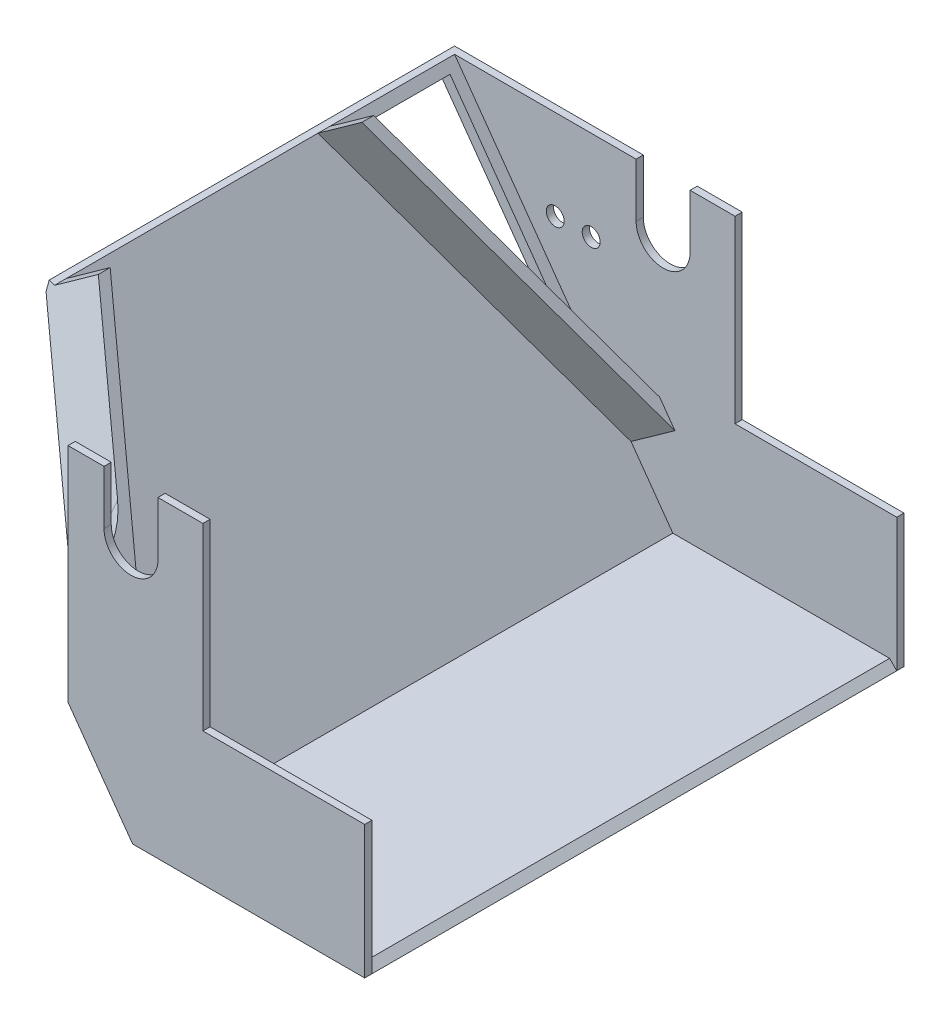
ISO-10303-21;
HEADER;
FILE_DESCRIPTION(('STEP AP214'),'2;1');
FILE_NAME('part.step','',(''),(''),'','','');
FILE_SCHEMA(('AUTOMOTIVE_DESIGN { 1 0 10303 214 1 1 1 1 }'));
ENDSEC;
DATA;
#1=APPLICATION_CONTEXT('core data for automotive mechanical design processes');
#2=APPLICATION_PROTOCOL_DEFINITION('international standard','automotive_design',2000,#1);
#3=PRODUCT_CONTEXT('',#1,'mechanical');
#4=PRODUCT('Part','Part','',(#3));
#5=PRODUCT_RELATED_PRODUCT_CATEGORY('part','',(#4));
#6=PRODUCT_DEFINITION_FORMATION('','',#4);
#7=PRODUCT_DEFINITION_CONTEXT('part definition',#1,'design');
#8=PRODUCT_DEFINITION('design','',#6,#7);
#9=PRODUCT_DEFINITION_SHAPE('','',#8);
#10=(LENGTH_UNIT() NAMED_UNIT(*) SI_UNIT(.MILLI.,.METRE.));
#11=(NAMED_UNIT(*) PLANE_ANGLE_UNIT() SI_UNIT($,.RADIAN.));
#12=(NAMED_UNIT(*) SI_UNIT($,.STERADIAN.) SOLID_ANGLE_UNIT());
#13=UNCERTAINTY_MEASURE_WITH_UNIT(LENGTH_MEASURE(1.E-05),#10,'distance_accuracy_value','');
#14=(GEOMETRIC_REPRESENTATION_CONTEXT(3) GLOBAL_UNCERTAINTY_ASSIGNED_CONTEXT((#13)) GLOBAL_UNIT_ASSIGNED_CONTEXT((#10,
#11,#12)) REPRESENTATION_CONTEXT('',''));
#15=CARTESIAN_POINT('',(0.,0.,0.));
#16=DIRECTION('',(0.,0.,1.));
#17=DIRECTION('',(1.,0.,0.));
#18=AXIS2_PLACEMENT_3D('',#15,#16,#17);
#19=CARTESIAN_POINT('',(143.111940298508,100.,-70.6082089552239));
#20=DIRECTION('',(0.,-1.,0.));
#21=DIRECTION('',(0.,0.,-1.));
#22=AXIS2_PLACEMENT_3D('',#19,#20,#21);
#23=PLANE('',#22);
#24=DIRECTION('',(0.,0.,1.));
#25=VECTOR('',#24,1.);
#26=CARTESIAN_POINT('',(33.1119402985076,100.,-70.6082089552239));
#27=LINE('',#26,#25);
#28=CARTESIAN_POINT('',(33.1119402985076,100.,-70.6082089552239));
#29=VERTEX_POINT('',#28);
#30=CARTESIAN_POINT('',(33.1119402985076,100.,42.1584289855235));
#31=VERTEX_POINT('',#30);
#32=EDGE_CURVE('E634',#29,#31,#27,.T.);
#33=ORIENTED_EDGE('',*,*,#32,.T.);
#34=DIRECTION('',(-0.967463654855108,0.,-0.25301003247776));
#35=VECTOR('',#34,1.);
#36=CARTESIAN_POINT('',(57.7651414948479,100.,48.6057070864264));
#37=LINE('',#36,#35);
#38=CARTESIAN_POINT('',(35.1119402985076,100.,42.681466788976));
#39=VERTEX_POINT('',#38);
#40=EDGE_CURVE('E320',#39,#31,#37,.T.);
#41=ORIENTED_EDGE('',*,*,#40,.F.);
#42=DIRECTION('',(0.,0.,1.));
#43=VECTOR('',#42,1.);
#44=CARTESIAN_POINT('',(35.1119402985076,100.,42.681466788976));
#45=LINE('',#44,#43);
#46=CARTESIAN_POINT('',(35.1119402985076,100.,39.3917910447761));
#47=VERTEX_POINT('',#46);
#48=EDGE_CURVE('E347',#47,#39,#45,.T.);
#49=ORIENTED_EDGE('',*,*,#48,.F.);
#50=DIRECTION('',(0.,0.,1.));
#51=VECTOR('',#50,1.);
#52=CARTESIAN_POINT('',(35.1119402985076,100.,-68.6082089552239));
#53=LINE('',#52,#51);
#54=CARTESIAN_POINT('',(35.1119402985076,100.,-30.6082089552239));
#55=VERTEX_POINT('',#54);
#56=EDGE_CURVE('E620',#55,#47,#53,.T.);
#57=ORIENTED_EDGE('',*,*,#56,.F.);
#58=DIRECTION('',(0.,0.,1.));
#59=VECTOR('',#58,1.);
#60=CARTESIAN_POINT('',(35.1119402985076,100.,-30.6082089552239));
#61=LINE('',#60,#59);
#62=CARTESIAN_POINT('',(35.1119402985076,100.,-33.8978846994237));
#63=VERTEX_POINT('',#62);
#64=EDGE_CURVE('E397',#63,#55,#61,.T.);
#65=ORIENTED_EDGE('',*,*,#64,.F.);
#66=CARTESIAN_POINT('',(35.1119402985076,100.,-68.6082089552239));
#67=VERTEX_POINT('',#66);
#68=EDGE_CURVE('E621',#67,#63,#53,.T.);
#69=ORIENTED_EDGE('',*,*,#68,.F.);
#70=DIRECTION('',(1.,0.,0.));
#71=VECTOR('',#70,1.);
#72=CARTESIAN_POINT('',(143.111940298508,100.,-68.6082089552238));
#73=LINE('',#72,#71);
#74=CARTESIAN_POINT('',(85.6119402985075,100.,-68.6082089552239));
#75=VERTEX_POINT('',#74);
#76=EDGE_CURVE('E647',#67,#75,#73,.T.);
#77=ORIENTED_EDGE('',*,*,#76,.T.);
#78=DIRECTION('',(0.,0.,1.));
#79=VECTOR('',#78,1.);
#80=CARTESIAN_POINT('',(85.6119402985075,100.,-74.3752854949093));
#81=LINE('',#80,#79);
#82=CARTESIAN_POINT('',(85.6119402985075,100.,-70.6082089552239));
#83=VERTEX_POINT('',#82);
#84=EDGE_CURVE('E570',#83,#75,#81,.T.);
#85=ORIENTED_EDGE('',*,*,#84,.F.);
#86=DIRECTION('',(1.,0.,0.));
#87=VECTOR('',#86,1.);
#88=CARTESIAN_POINT('',(143.111940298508,100.,-70.6082089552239));
#89=LINE('',#88,#87);
#90=EDGE_CURVE('E630',#29,#83,#89,.T.);
#91=ORIENTED_EDGE('',*,*,#90,.F.);
#92=EDGE_LOOP('',(#33,#41,#49,#57,#65,#69,#77,#85,#91));
#93=FACE_BOUND('',#92,.T.);
#94=ADVANCED_FACE('F47',(#93),#23,.F.);
#95=CARTESIAN_POINT('',(35.1119402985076,-197.25799906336,-68.6082089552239));
#96=DIRECTION('',(0.,0.,-1.));
#97=DIRECTION('',(-1.,0.,0.));
#98=AXIS2_PLACEMENT_3D('',#95,#96,#97);
#99=PLANE('',#98);
#100=CARTESIAN_POINT('',(63.1119402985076,75.,-68.6082089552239));
#101=DIRECTION('',(0.,0.,-1.));
#102=DIRECTION('',(-1.,0.,0.));
#103=AXIS2_PLACEMENT_3D('',#100,#101,#102);
#104=CIRCLE('',#103,2.5);
#105=CARTESIAN_POINT('',(60.6119402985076,75.,-68.6082089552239));
#106=VERTEX_POINT('',#105);
#107=EDGE_CURVE('E484',#106,#106,#104,.T.);
#108=ORIENTED_EDGE('',*,*,#107,.T.);
#109=EDGE_LOOP('',(#108));
#110=FACE_BOUND('',#109,.T.);
#111=CARTESIAN_POINT('',(73.1119402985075,75.,-68.6082089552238));
#112=DIRECTION('',(0.,0.,-1.));
#113=DIRECTION('',(-1.,0.,0.));
#114=AXIS2_PLACEMENT_3D('',#111,#112,#113);
#115=CIRCLE('',#114,2.50000000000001);
#116=CARTESIAN_POINT('',(70.6119402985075,75.,-68.6082089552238));
#117=VERTEX_POINT('',#116);
#118=EDGE_CURVE('E491',#117,#117,#115,.T.);
#119=ORIENTED_EDGE('',*,*,#118,.T.);
#120=EDGE_LOOP('',(#119));
#121=FACE_BOUND('',#120,.T.);
#122=DIRECTION('',(-0.813733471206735,-0.581238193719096,0.));
#123=VECTOR('',#122,1.);
#124=CARTESIAN_POINT('',(92.1577639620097,45.9428226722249,-68.6082089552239));
#125=LINE('',#124,#123);
#126=CARTESIAN_POINT('',(92.1577639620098,45.9428226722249,-68.6082089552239));
#127=VERTEX_POINT('',#126);
#128=CARTESIAN_POINT('',(79.9517618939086,37.2242497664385,-68.6082089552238));
#129=VERTEX_POINT('',#128);
#130=EDGE_CURVE('E341',#127,#129,#125,.T.);
#131=ORIENTED_EDGE('',*,*,#130,.F.);
#132=DIRECTION('',(-0.581238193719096,0.813733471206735,0.));
#133=VECTOR('',#132,1.);
#134=CARTESIAN_POINT('',(92.1577639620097,45.9428226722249,-68.6082089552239));
#135=LINE('',#134,#133);
#136=CARTESIAN_POINT('',(96.4074642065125,39.9932423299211,-68.6082089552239));
#137=VERTEX_POINT('',#136);
#138=EDGE_CURVE('E398',#137,#127,#135,.T.);
#139=ORIENTED_EDGE('',*,*,#138,.F.);
#140=DIRECTION('',(-0.813733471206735,-0.581238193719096,0.));
#141=VECTOR('',#140,1.);
#142=CARTESIAN_POINT('',(96.4074642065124,39.9932423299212,-68.6082089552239));
#143=LINE('',#142,#141);
#144=CARTESIAN_POINT('',(84.2014621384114,31.2746694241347,-68.6082089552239));
#145=VERTEX_POINT('',#144);
#146=EDGE_CURVE('E388',#137,#145,#143,.T.);
#147=ORIENTED_EDGE('',*,*,#146,.T.);
#148=DIRECTION('',(0.581238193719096,-0.813733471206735,0.));
#149=VECTOR('',#148,1.);
#150=CARTESIAN_POINT('',(35.1119402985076,100.,-68.6082089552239));
#151=LINE('',#150,#149);
#152=CARTESIAN_POINT('',(95.8262260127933,15.,-68.6082089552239));
#153=VERTEX_POINT('',#152);
#154=EDGE_CURVE('E550',#145,#153,#151,.T.);
#155=ORIENTED_EDGE('',*,*,#154,.T.);
#156=DIRECTION('',(1.,0.,0.));
#157=VECTOR('',#156,1.);
#158=CARTESIAN_POINT('',(35.1119402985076,15.,-68.6082089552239));
#159=LINE('',#158,#157);
#160=CARTESIAN_POINT('',(156.111940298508,15.,-68.6082089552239));
#161=VERTEX_POINT('',#160);
#162=EDGE_CURVE('E544',#153,#161,#159,.T.);
#163=ORIENTED_EDGE('',*,*,#162,.T.);
#164=DIRECTION('',(-0.707106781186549,0.707106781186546,0.));
#165=VECTOR('',#164,1.);
#166=CARTESIAN_POINT('',(94.6109402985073,76.501,-68.6082089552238));
#167=LINE('',#166,#165);
#168=CARTESIAN_POINT('',(158.111940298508,13.,-68.6082089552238));
#169=VERTEX_POINT('',#168);
#170=EDGE_CURVE('E456',#169,#161,#167,.T.);
#171=ORIENTED_EDGE('',*,*,#170,.F.);
#172=DIRECTION('',(0.,-1.,0.));
#173=VECTOR('',#172,1.);
#174=CARTESIAN_POINT('',(158.111940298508,13.,-68.6082089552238));
#175=LINE('',#174,#173);
#176=CARTESIAN_POINT('',(158.111940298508,50.,-68.6082089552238));
#177=VERTEX_POINT('',#176);
#178=EDGE_CURVE('E438',#177,#169,#175,.T.);
#179=ORIENTED_EDGE('',*,*,#178,.F.);
#180=DIRECTION('',(-1.,0.,0.));
#181=VECTOR('',#180,1.);
#182=CARTESIAN_POINT('',(35.1119402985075,50.,-68.6082089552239));
#183=LINE('',#182,#181);
#184=CARTESIAN_POINT('',(113.111940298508,50.,-68.6082089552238));
#185=VERTEX_POINT('',#184);
#186=EDGE_CURVE('E529',#177,#185,#183,.T.);
#187=ORIENTED_EDGE('',*,*,#186,.T.);
#188=DIRECTION('',(0.,1.,0.));
#189=VECTOR('',#188,1.);
#190=CARTESIAN_POINT('',(113.111940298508,-197.25799906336,-68.6082089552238));
#191=LINE('',#190,#189);
#192=CARTESIAN_POINT('',(113.111940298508,100.,-68.6082089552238));
#193=VERTEX_POINT('',#192);
#194=EDGE_CURVE('E522',#185,#193,#191,.T.);
#195=ORIENTED_EDGE('',*,*,#194,.T.);
#196=CARTESIAN_POINT('',(100.611940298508,100.,-68.6082089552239));
#197=VERTEX_POINT('',#196);
#198=EDGE_CURVE('E646',#197,#193,#73,.T.);
#199=ORIENTED_EDGE('',*,*,#198,.F.);
#200=DIRECTION('',(0.,-1.,0.));
#201=VECTOR('',#200,1.);
#202=CARTESIAN_POINT('',(100.611940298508,-197.25799906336,-68.6082089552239));
#203=LINE('',#202,#201);
#204=CARTESIAN_POINT('',(100.611940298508,85.,-68.6082089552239));
#205=VERTEX_POINT('',#204);
#206=EDGE_CURVE('E577',#197,#205,#203,.T.);
#207=ORIENTED_EDGE('',*,*,#206,.T.);
#208=CARTESIAN_POINT('',(93.1119402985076,85.,-68.6082089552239));
#209=DIRECTION('',(0.,0.,-1.));
#210=DIRECTION('',(-1.,0.,0.));
#211=AXIS2_PLACEMENT_3D('',#208,#209,#210);
#212=CIRCLE('',#211,7.50000000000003);
#213=CARTESIAN_POINT('',(85.6119402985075,85.,-68.6082089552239));
#214=VERTEX_POINT('',#213);
#215=EDGE_CURVE('E612',#205,#214,#212,.T.);
#216=ORIENTED_EDGE('',*,*,#215,.T.);
#217=DIRECTION('',(0.,1.,0.));
#218=VECTOR('',#217,1.);
#219=CARTESIAN_POINT('',(85.6119402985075,-197.25799906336,-68.6082089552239));
#220=LINE('',#219,#218);
#221=EDGE_CURVE('E599',#214,#75,#220,.T.);
#222=ORIENTED_EDGE('',*,*,#221,.T.);
#223=ORIENTED_EDGE('',*,*,#76,.F.);
#224=EDGE_CURVE('E551',#67,#129,#151,.T.);
#225=ORIENTED_EDGE('',*,*,#224,.T.);
#226=EDGE_LOOP('',(#131,#139,#147,#155,#163,#171,#179,#187,#195,#199,#207,#216,#222,#223,#225));
#227=FACE_BOUND('',#226,.T.);
#228=ADVANCED_FACE('F720',(#110,#121,#227),#99,.F.);
#229=CARTESIAN_POINT('',(35.1119402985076,-197.25799906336,77.3917910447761));
#230=DIRECTION('',(0.,0.,1.));
#231=DIRECTION('',(1.,0.,0.));
#232=AXIS2_PLACEMENT_3D('',#229,#230,#231);
#233=PLANE('',#232);
#234=DIRECTION('',(0.581238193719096,-0.813733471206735,0.));
#235=VECTOR('',#234,1.);
#236=CARTESIAN_POINT('',(92.1577639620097,45.9428226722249,77.3917910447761));
#237=LINE('',#236,#235);
#238=CARTESIAN_POINT('',(75.6119402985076,69.1069758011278,77.3917910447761));
#239=VERTEX_POINT('',#238);
#240=CARTESIAN_POINT('',(96.4074642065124,39.9932423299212,77.3917910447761));
#241=VERTEX_POINT('',#240);
#242=EDGE_CURVE('E342',#239,#241,#237,.T.);
#243=ORIENTED_EDGE('',*,*,#242,.F.);
#244=DIRECTION('',(0.,1.,0.));
#245=VECTOR('',#244,1.);
#246=CARTESIAN_POINT('',(75.6119402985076,-197.25799906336,77.3917910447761));
#247=LINE('',#246,#245);
#248=CARTESIAN_POINT('',(75.6119402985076,100.,77.3917910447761));
#249=VERTEX_POINT('',#248);
#250=EDGE_CURVE('E336',#239,#249,#247,.T.);
#251=ORIENTED_EDGE('',*,*,#250,.T.);
#252=DIRECTION('',(1.,0.,0.));
#253=VECTOR('',#252,1.);
#254=CARTESIAN_POINT('',(35.1119402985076,100.,77.3917910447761));
#255=LINE('',#254,#253);
#256=CARTESIAN_POINT('',(85.6119402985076,100.,77.3917910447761));
#257=VERTEX_POINT('',#256);
#258=EDGE_CURVE('E626',#249,#257,#255,.T.);
#259=ORIENTED_EDGE('',*,*,#258,.T.);
#260=DIRECTION('',(0.,1.,0.));
#261=VECTOR('',#260,1.);
#262=CARTESIAN_POINT('',(85.6119402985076,85.,77.3917910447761));
#263=LINE('',#262,#261);
#264=CARTESIAN_POINT('',(85.6119402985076,85.,77.3917910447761));
#265=VERTEX_POINT('',#264);
#266=EDGE_CURVE('E573',#265,#257,#263,.T.);
#267=ORIENTED_EDGE('',*,*,#266,.F.);
#268=CARTESIAN_POINT('',(93.1119402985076,85.,77.3917910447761));
#269=DIRECTION('',(0.,0.,1.));
#270=DIRECTION('',(1.,0.,0.));
#271=AXIS2_PLACEMENT_3D('',#268,#269,#270);
#272=CIRCLE('',#271,7.50000000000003);
#273=CARTESIAN_POINT('',(100.611940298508,85.,77.3917910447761));
#274=VERTEX_POINT('',#273);
#275=EDGE_CURVE('E611',#265,#274,#272,.T.);
#276=ORIENTED_EDGE('',*,*,#275,.T.);
#277=DIRECTION('',(0.,1.,0.));
#278=VECTOR('',#277,1.);
#279=CARTESIAN_POINT('',(100.611940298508,85.,77.3917910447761));
#280=LINE('',#279,#278);
#281=CARTESIAN_POINT('',(100.611940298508,100.,77.3917910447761));
#282=VERTEX_POINT('',#281);
#283=EDGE_CURVE('E578',#274,#282,#280,.T.);
#284=ORIENTED_EDGE('',*,*,#283,.T.);
#285=CARTESIAN_POINT('',(113.111940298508,100.,77.3917910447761));
#286=VERTEX_POINT('',#285);
#287=EDGE_CURVE('E625',#282,#286,#255,.T.);
#288=ORIENTED_EDGE('',*,*,#287,.T.);
#289=DIRECTION('',(0.,-1.,0.));
#290=VECTOR('',#289,1.);
#291=CARTESIAN_POINT('',(113.111940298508,-197.25799906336,77.3917910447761));
#292=LINE('',#291,#290);
#293=CARTESIAN_POINT('',(113.111940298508,50.,77.3917910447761));
#294=VERTEX_POINT('',#293);
#295=EDGE_CURVE('E514',#286,#294,#292,.T.);
#296=ORIENTED_EDGE('',*,*,#295,.T.);
#297=DIRECTION('',(1.,0.,0.));
#298=VECTOR('',#297,1.);
#299=CARTESIAN_POINT('',(35.1119402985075,50.,77.3917910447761));
#300=LINE('',#299,#298);
#301=CARTESIAN_POINT('',(158.111940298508,50.,77.3917910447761));
#302=VERTEX_POINT('',#301);
#303=EDGE_CURVE('E526',#294,#302,#300,.T.);
#304=ORIENTED_EDGE('',*,*,#303,.T.);
#305=DIRECTION('',(0.,1.,0.));
#306=VECTOR('',#305,1.);
#307=CARTESIAN_POINT('',(158.111940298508,50.,77.3917910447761));
#308=LINE('',#307,#306);
#309=CARTESIAN_POINT('',(158.111940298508,13.,77.3917910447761));
#310=VERTEX_POINT('',#309);
#311=EDGE_CURVE('E426',#310,#302,#308,.T.);
#312=ORIENTED_EDGE('',*,*,#311,.F.);
#313=DIRECTION('',(0.707106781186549,-0.707106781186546,0.));
#314=VECTOR('',#313,1.);
#315=CARTESIAN_POINT('',(94.6109402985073,76.501,77.3917910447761));
#316=LINE('',#315,#314);
#317=CARTESIAN_POINT('',(156.111940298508,15.,77.3917910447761));
#318=VERTEX_POINT('',#317);
#319=EDGE_CURVE('E452',#318,#310,#316,.T.);
#320=ORIENTED_EDGE('',*,*,#319,.F.);
#321=DIRECTION('',(-1.,0.,0.));
#322=VECTOR('',#321,1.);
#323=CARTESIAN_POINT('',(35.1119402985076,15.,77.3917910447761));
#324=LINE('',#323,#322);
#325=CARTESIAN_POINT('',(95.8262260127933,15.,77.3917910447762));
#326=VERTEX_POINT('',#325);
#327=EDGE_CURVE('E540',#318,#326,#324,.T.);
#328=ORIENTED_EDGE('',*,*,#327,.T.);
#329=DIRECTION('',(0.581238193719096,-0.813733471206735,0.));
#330=VECTOR('',#329,1.);
#331=CARTESIAN_POINT('',(35.1119402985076,100.,77.3917910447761));
#332=LINE('',#331,#330);
#333=CARTESIAN_POINT('',(84.2014621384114,31.2746694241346,77.3917910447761));
#334=VERTEX_POINT('',#333);
#335=EDGE_CURVE('E547',#334,#326,#332,.T.);
#336=ORIENTED_EDGE('',*,*,#335,.F.);
#337=DIRECTION('',(-0.813733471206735,-0.581238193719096,0.));
#338=VECTOR('',#337,1.);
#339=CARTESIAN_POINT('',(96.4074642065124,39.9932423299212,77.3917910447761));
#340=LINE('',#339,#338);
#341=EDGE_CURVE('E372',#241,#334,#340,.T.);
#342=ORIENTED_EDGE('',*,*,#341,.F.);
#343=EDGE_LOOP('',(#243,#251,#259,#267,#276,#284,#288,#296,#304,#312,#320,#328,#336,#342));
#344=FACE_BOUND('',#343,.T.);
#345=ADVANCED_FACE('F696',(#344),#233,.F.);
#346=CARTESIAN_POINT('',(35.1119402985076,100.,-189.040762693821));
#347=DIRECTION('',(-0.813733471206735,-0.581238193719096,0.));
#348=DIRECTION('',(0.581238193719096,-0.813733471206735,0.));
#349=AXIS2_PLACEMENT_3D('',#346,#347,#348);
#350=PLANE('',#349);
#351=DIRECTION('',(-0.530056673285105,0.742079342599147,-0.410314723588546));
#352=VECTOR('',#351,1.);
#353=CARTESIAN_POINT('',(84.2014621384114,31.2746694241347,77.3917910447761));
#354=LINE('',#353,#352);
#355=EDGE_CURVE('E357',#334,#47,#354,.T.);
#356=ORIENTED_EDGE('',*,*,#355,.F.);
#357=ORIENTED_EDGE('',*,*,#335,.T.);
#358=DIRECTION('',(0.,0.,-1.));
#359=VECTOR('',#358,1.);
#360=CARTESIAN_POINT('',(95.8262260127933,15.,-189.040762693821));
#361=LINE('',#360,#359);
#362=EDGE_CURVE('E660',#326,#153,#361,.T.);
#363=ORIENTED_EDGE('',*,*,#362,.T.);
#364=ORIENTED_EDGE('',*,*,#154,.F.);
#365=DIRECTION('',(0.530056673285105,-0.742079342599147,-0.410314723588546));
#366=VECTOR('',#365,1.);
#367=CARTESIAN_POINT('',(84.2014621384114,31.2746694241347,-68.6082089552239));
#368=LINE('',#367,#366);
#369=EDGE_CURVE('E393',#55,#145,#368,.T.);
#370=ORIENTED_EDGE('',*,*,#369,.F.);
#371=ORIENTED_EDGE('',*,*,#56,.T.);
#372=EDGE_LOOP('',(#356,#357,#363,#364,#370,#371));
#373=FACE_BOUND('',#372,.T.);
#374=ADVANCED_FACE('F800',(#373),#350,.F.);
#375=DIRECTION('',(0.,0.,1.));
#376=VECTOR('',#375,1.);
#377=CARTESIAN_POINT('',(36.8556548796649,97.5587995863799,-65.6082089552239));
#378=LINE('',#377,#376);
#379=CARTESIAN_POINT('',(36.8556548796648,97.5587995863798,-65.6082089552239));
#380=VERTEX_POINT('',#379);
#381=CARTESIAN_POINT('',(36.8556548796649,97.5587995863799,-38.5373628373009));
#382=VERTEX_POINT('',#381);
#383=EDGE_CURVE('E299',#380,#382,#378,.T.);
#384=ORIENTED_EDGE('',*,*,#383,.F.);
#385=DIRECTION('',(-0.581238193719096,0.813733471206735,0.));
#386=VECTOR('',#385,1.);
#387=CARTESIAN_POINT('',(36.8556548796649,97.5587995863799,-65.6082089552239));
#388=LINE('',#387,#386);
#389=CARTESIAN_POINT('',(71.8265730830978,48.5995141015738,-65.6082089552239));
#390=VERTEX_POINT('',#389);
#391=EDGE_CURVE('E304',#390,#380,#388,.T.);
#392=ORIENTED_EDGE('',*,*,#391,.F.);
#393=DIRECTION('',(0.530056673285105,-0.742079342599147,-0.410314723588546));
#394=VECTOR('',#393,1.);
#395=CARTESIAN_POINT('',(71.8265730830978,48.5995141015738,-65.6082089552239));
#396=LINE('',#395,#394);
#397=EDGE_CURVE('E287',#382,#390,#396,.T.);
#398=ORIENTED_EDGE('',*,*,#397,.F.);
#399=EDGE_LOOP('',(#384,#392,#398));
#400=FACE_BOUND('',#399,.T.);
#401=DIRECTION('',(-0.530056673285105,0.742079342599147,0.410314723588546));
#402=VECTOR('',#401,1.);
#403=CARTESIAN_POINT('',(79.9517618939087,37.2242497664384,-68.6082089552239));
#404=LINE('',#403,#402);
#405=EDGE_CURVE('E361',#129,#63,#404,.T.);
#406=ORIENTED_EDGE('',*,*,#405,.F.);
#407=ORIENTED_EDGE('',*,*,#224,.F.);
#408=ORIENTED_EDGE('',*,*,#68,.T.);
#409=EDGE_LOOP('',(#406,#407,#408));
#410=FACE_BOUND('',#409,.T.);
#411=ADVANCED_FACE('F306',(#400,#410),#350,.F.);
#412=ORIENTED_EDGE('',*,*,#258,.F.);
#413=DIRECTION('',(0.,0.,1.));
#414=VECTOR('',#413,1.);
#415=CARTESIAN_POINT('',(75.6119402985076,100.,-19.6371567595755));
#416=LINE('',#415,#414);
#417=CARTESIAN_POINT('',(75.6119402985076,100.,79.3917910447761));
#418=VERTEX_POINT('',#417);
#419=EDGE_CURVE('E324',#249,#418,#416,.T.);
#420=ORIENTED_EDGE('',*,*,#419,.T.);
#421=DIRECTION('',(1.,0.,0.));
#422=VECTOR('',#421,1.);
#423=CARTESIAN_POINT('',(143.111940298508,100.,79.3917910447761));
#424=LINE('',#423,#422);
#425=CARTESIAN_POINT('',(85.6119402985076,100.,79.3917910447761));
#426=VERTEX_POINT('',#425);
#427=EDGE_CURVE('E636',#418,#426,#424,.T.);
#428=ORIENTED_EDGE('',*,*,#427,.T.);
#429=DIRECTION('',(0.,0.,1.));
#430=VECTOR('',#429,1.);
#431=CARTESIAN_POINT('',(85.6119402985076,100.,79.3917910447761));
#432=LINE('',#431,#430);
#433=EDGE_CURVE('E566',#257,#426,#432,.T.);
#434=ORIENTED_EDGE('',*,*,#433,.F.);
#435=EDGE_LOOP('',(#412,#420,#428,#434));
#436=FACE_BOUND('',#435,.T.);
#437=ADVANCED_FACE('F722',(#436),#23,.F.);
#438=CARTESIAN_POINT('',(100.611940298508,100.,79.3917910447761));
#439=VERTEX_POINT('',#438);
#440=CARTESIAN_POINT('',(113.111940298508,100.,79.3917910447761));
#441=VERTEX_POINT('',#440);
#442=EDGE_CURVE('E629',#439,#441,#424,.T.);
#443=ORIENTED_EDGE('',*,*,#442,.T.);
#444=DIRECTION('',(0.,0.,1.));
#445=VECTOR('',#444,1.);
#446=CARTESIAN_POINT('',(113.111940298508,100.,-70.6082089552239));
#447=LINE('',#446,#445);
#448=EDGE_CURVE('E504',#286,#441,#447,.T.);
#449=ORIENTED_EDGE('',*,*,#448,.F.);
#450=ORIENTED_EDGE('',*,*,#287,.F.);
#451=DIRECTION('',(0.,0.,-1.));
#452=VECTOR('',#451,1.);
#453=CARTESIAN_POINT('',(100.611940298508,100.,79.3917910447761));
#454=LINE('',#453,#452);
#455=EDGE_CURVE('E561',#439,#282,#454,.T.);
#456=ORIENTED_EDGE('',*,*,#455,.F.);
#457=EDGE_LOOP('',(#443,#449,#450,#456));
#458=FACE_BOUND('',#457,.T.);
#459=ADVANCED_FACE('F731',(#458),#23,.F.);
#460=CARTESIAN_POINT('',(93.1119402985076,85.,-70.6082089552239));
#461=DIRECTION('',(0.,0.,1.));
#462=DIRECTION('',(1.,0.,0.));
#463=AXIS2_PLACEMENT_3D('',#460,#461,#462);
#464=CYLINDRICAL_SURFACE('',#463,7.50000000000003);
#465=DIRECTION('',(0.,0.,1.));
#466=VECTOR('',#465,1.);
#467=CARTESIAN_POINT('',(85.6119402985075,85.,-70.6082089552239));
#468=LINE('',#467,#466);
#469=CARTESIAN_POINT('',(85.6119402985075,85.,-70.6082089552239));
#470=VERTEX_POINT('',#469);
#471=EDGE_CURVE('E657',#214,#470,#468,.F.);
#472=ORIENTED_EDGE('',*,*,#471,.F.);
#473=ORIENTED_EDGE('',*,*,#215,.F.);
#474=DIRECTION('',(0.,0.,1.));
#475=VECTOR('',#474,1.);
#476=CARTESIAN_POINT('',(100.611940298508,85.,-70.6082089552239));
#477=LINE('',#476,#475);
#478=CARTESIAN_POINT('',(100.611940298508,85.,-70.6082089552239));
#479=VERTEX_POINT('',#478);
#480=EDGE_CURVE('E651',#479,#205,#477,.T.);
#481=ORIENTED_EDGE('',*,*,#480,.F.);
#482=CARTESIAN_POINT('',(93.1119402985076,85.,-70.6082089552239));
#483=DIRECTION('',(0.,0.,1.));
#484=DIRECTION('',(1.,0.,0.));
#485=AXIS2_PLACEMENT_3D('',#482,#483,#484);
#486=CIRCLE('',#485,7.50000000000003);
#487=EDGE_CURVE('E607',#470,#479,#486,.T.);
#488=ORIENTED_EDGE('',*,*,#487,.F.);
#489=EDGE_LOOP('',(#472,#473,#481,#488));
#490=FACE_BOUND('',#489,.T.);
#491=ADVANCED_FACE('F745',(#490),#464,.F.);
#492=CARTESIAN_POINT('',(33.1119402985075,200.,-70.6082089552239));
#493=DIRECTION('',(1.,0.,0.));
#494=DIRECTION('',(0.,0.,-1.));
#495=AXIS2_PLACEMENT_3D('',#492,#493,#494);
#496=PLANE('',#495);
#497=DIRECTION('',(0.,0.,1.));
#498=VECTOR('',#497,1.);
#499=CARTESIAN_POINT('',(33.1119402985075,97.6386048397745,-70.6082089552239));
#500=LINE('',#499,#498);
#501=CARTESIAN_POINT('',(33.1119402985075,97.6386048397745,-70.6082089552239));
#502=VERTEX_POINT('',#501);
#503=CARTESIAN_POINT('',(33.1119402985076,97.6386048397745,43.0229982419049));
#504=VERTEX_POINT('',#503);
#505=EDGE_CURVE('E475',#502,#504,#500,.T.);
#506=ORIENTED_EDGE('',*,*,#505,.T.);
#507=DIRECTION('',(0.,-0.939040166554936,0.34380745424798));
#508=VECTOR('',#507,1.);
#509=CARTESIAN_POINT('',(33.1119402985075,119.95064362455,34.85397041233));
#510=LINE('',#509,#508);
#511=EDGE_CURVE('E315',#31,#504,#510,.T.);
#512=ORIENTED_EDGE('',*,*,#511,.F.);
#513=ORIENTED_EDGE('',*,*,#32,.F.);
#514=DIRECTION('',(0.,-1.,0.));
#515=VECTOR('',#514,1.);
#516=CARTESIAN_POINT('',(33.1119402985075,200.,-70.6082089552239));
#517=LINE('',#516,#515);
#518=EDGE_CURVE('E642',#29,#502,#517,.T.);
#519=ORIENTED_EDGE('',*,*,#518,.T.);
#520=EDGE_LOOP('',(#506,#512,#513,#519));
#521=FACE_BOUND('',#520,.T.);
#522=ADVANCED_FACE('F691',(#521),#496,.F.);
#523=CARTESIAN_POINT('',(33.1119402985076,200.,79.3917910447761));
#524=DIRECTION('',(0.,0.,-1.));
#525=DIRECTION('',(-1.,0.,0.));
#526=AXIS2_PLACEMENT_3D('',#523,#524,#525);
#527=PLANE('',#526);
#528=ORIENTED_EDGE('',*,*,#427,.F.);
#529=DIRECTION('',(0.,-1.,0.));
#530=VECTOR('',#529,1.);
#531=CARTESIAN_POINT('',(75.6119402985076,200.,79.3917910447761));
#532=LINE('',#531,#530);
#533=CARTESIAN_POINT('',(75.6119402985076,38.1386048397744,79.3917910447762));
#534=VERTEX_POINT('',#533);
#535=EDGE_CURVE('E323',#418,#534,#532,.T.);
#536=ORIENTED_EDGE('',*,*,#535,.T.);
#537=DIRECTION('',(-0.581238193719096,0.813733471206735,0.));
#538=VECTOR('',#537,1.);
#539=CARTESIAN_POINT('',(33.1119402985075,97.6386048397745,79.3917910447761));
#540=LINE('',#539,#538);
#541=CARTESIAN_POINT('',(93.5680866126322,13.,79.3917910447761));
#542=VERTEX_POINT('',#541);
#543=EDGE_CURVE('E464',#542,#534,#540,.T.);
#544=ORIENTED_EDGE('',*,*,#543,.F.);
#545=DIRECTION('',(-1.,0.,0.));
#546=VECTOR('',#545,1.);
#547=CARTESIAN_POINT('',(33.1119402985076,13.,79.3917910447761));
#548=LINE('',#547,#546);
#549=CARTESIAN_POINT('',(158.111940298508,13.,79.3917910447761));
#550=VERTEX_POINT('',#549);
#551=EDGE_CURVE('E536',#550,#542,#548,.T.);
#552=ORIENTED_EDGE('',*,*,#551,.F.);
#553=DIRECTION('',(0.,-1.,0.));
#554=VECTOR('',#553,1.);
#555=CARTESIAN_POINT('',(158.111940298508,50.,79.3917910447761));
#556=LINE('',#555,#554);
#557=CARTESIAN_POINT('',(158.111940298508,50.,79.3917910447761));
#558=VERTEX_POINT('',#557);
#559=EDGE_CURVE('E417',#558,#550,#556,.T.);
#560=ORIENTED_EDGE('',*,*,#559,.F.);
#561=DIRECTION('',(1.,0.,0.));
#562=VECTOR('',#561,1.);
#563=CARTESIAN_POINT('',(143.111940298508,50.,79.3917910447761));
#564=LINE('',#563,#562);
#565=CARTESIAN_POINT('',(113.111940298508,50.,79.3917910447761));
#566=VERTEX_POINT('',#565);
#567=EDGE_CURVE('E501',#566,#558,#564,.T.);
#568=ORIENTED_EDGE('',*,*,#567,.F.);
#569=DIRECTION('',(0.,-1.,0.));
#570=VECTOR('',#569,1.);
#571=CARTESIAN_POINT('',(113.111940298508,100.,79.3917910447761));
#572=LINE('',#571,#570);
#573=EDGE_CURVE('E495',#441,#566,#572,.T.);
#574=ORIENTED_EDGE('',*,*,#573,.F.);
#575=ORIENTED_EDGE('',*,*,#442,.F.);
#576=DIRECTION('',(0.,1.,0.));
#577=VECTOR('',#576,1.);
#578=CARTESIAN_POINT('',(100.611940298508,85.,79.3917910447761));
#579=LINE('',#578,#577);
#580=CARTESIAN_POINT('',(100.611940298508,85.,79.3917910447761));
#581=VERTEX_POINT('',#580);
#582=EDGE_CURVE('E582',#581,#439,#579,.T.);
#583=ORIENTED_EDGE('',*,*,#582,.F.);
#584=CARTESIAN_POINT('',(93.1119402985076,85.,79.3917910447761));
#585=DIRECTION('',(0.,0.,-1.));
#586=DIRECTION('',(-1.,0.,0.));
#587=AXIS2_PLACEMENT_3D('',#584,#585,#586);
#588=CIRCLE('',#587,7.50000000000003);
#589=CARTESIAN_POINT('',(85.6119402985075,85.,79.3917910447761));
#590=VERTEX_POINT('',#589);
#591=EDGE_CURVE('E616',#581,#590,#588,.T.);
#592=ORIENTED_EDGE('',*,*,#591,.T.);
#593=DIRECTION('',(0.,1.,0.));
#594=VECTOR('',#593,1.);
#595=CARTESIAN_POINT('',(85.6119402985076,85.,79.3917910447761));
#596=LINE('',#595,#594);
#597=EDGE_CURVE('E565',#590,#426,#596,.T.);
#598=ORIENTED_EDGE('',*,*,#597,.T.);
#599=EDGE_LOOP('',(#528,#536,#544,#552,#560,#568,#574,#575,#583,#592,#598));
#600=FACE_BOUND('',#599,.T.);
#601=ADVANCED_FACE('F747',(#600),#527,.F.);
#602=CARTESIAN_POINT('',(33.1119402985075,200.,-70.6082089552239));
#603=DIRECTION('',(0.,0.,1.));
#604=DIRECTION('',(1.,0.,0.));
#605=AXIS2_PLACEMENT_3D('',#602,#603,#604);
#606=PLANE('',#605);
#607=CARTESIAN_POINT('',(73.1119402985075,75.,-70.6082089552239));
#608=DIRECTION('',(0.,0.,-1.));
#609=DIRECTION('',(-1.,0.,0.));
#610=AXIS2_PLACEMENT_3D('',#607,#608,#609);
#611=CIRCLE('',#610,2.50000000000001);
#612=CARTESIAN_POINT('',(70.6119402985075,75.,-70.6082089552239));
#613=VERTEX_POINT('',#612);
#614=EDGE_CURVE('E480',#613,#613,#611,.T.);
#615=ORIENTED_EDGE('',*,*,#614,.F.);
#616=EDGE_LOOP('',(#615));
#617=FACE_BOUND('',#616,.T.);
#618=CARTESIAN_POINT('',(63.1119402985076,75.,-70.6082089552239));
#619=DIRECTION('',(0.,0.,-1.));
#620=DIRECTION('',(-1.,0.,0.));
#621=AXIS2_PLACEMENT_3D('',#618,#619,#620);
#622=CIRCLE('',#621,2.5);
#623=CARTESIAN_POINT('',(60.6119402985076,75.,-70.6082089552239));
#624=VERTEX_POINT('',#623);
#625=EDGE_CURVE('E479',#624,#624,#622,.T.);
#626=ORIENTED_EDGE('',*,*,#625,.F.);
#627=EDGE_LOOP('',(#626));
#628=FACE_BOUND('',#627,.T.);
#629=DIRECTION('',(1.,0.,0.));
#630=VECTOR('',#629,1.);
#631=CARTESIAN_POINT('',(33.1119402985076,13.,-70.6082089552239));
#632=LINE('',#631,#630);
#633=CARTESIAN_POINT('',(93.5680866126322,13.,-70.6082089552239));
#634=VERTEX_POINT('',#633);
#635=CARTESIAN_POINT('',(158.111940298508,13.,-70.6082089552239));
#636=VERTEX_POINT('',#635);
#637=EDGE_CURVE('E533',#634,#636,#632,.T.);
#638=ORIENTED_EDGE('',*,*,#637,.F.);
#639=DIRECTION('',(-0.581238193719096,0.813733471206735,0.));
#640=VECTOR('',#639,1.);
#641=CARTESIAN_POINT('',(33.1119402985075,97.6386048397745,-70.6082089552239));
#642=LINE('',#641,#640);
#643=EDGE_CURVE('E468',#634,#502,#642,.T.);
#644=ORIENTED_EDGE('',*,*,#643,.T.);
#645=ORIENTED_EDGE('',*,*,#518,.F.);
#646=ORIENTED_EDGE('',*,*,#90,.T.);
#647=DIRECTION('',(0.,-1.,0.));
#648=VECTOR('',#647,1.);
#649=CARTESIAN_POINT('',(85.6119402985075,200.,-70.6082089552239));
#650=LINE('',#649,#648);
#651=EDGE_CURVE('E603',#83,#470,#650,.T.);
#652=ORIENTED_EDGE('',*,*,#651,.T.);
#653=ORIENTED_EDGE('',*,*,#487,.T.);
#654=DIRECTION('',(0.,1.,0.));
#655=VECTOR('',#654,1.);
#656=CARTESIAN_POINT('',(100.611940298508,200.,-70.6082089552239));
#657=LINE('',#656,#655);
#658=CARTESIAN_POINT('',(100.611940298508,100.,-70.6082089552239));
#659=VERTEX_POINT('',#658);
#660=EDGE_CURVE('E595',#479,#659,#657,.T.);
#661=ORIENTED_EDGE('',*,*,#660,.T.);
#662=CARTESIAN_POINT('',(113.111940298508,100.,-70.6082089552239));
#663=VERTEX_POINT('',#662);
#664=EDGE_CURVE('E635',#659,#663,#89,.T.);
#665=ORIENTED_EDGE('',*,*,#664,.T.);
#666=DIRECTION('',(0.,-1.,0.));
#667=VECTOR('',#666,1.);
#668=CARTESIAN_POINT('',(113.111940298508,100.,-70.6082089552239));
#669=LINE('',#668,#667);
#670=CARTESIAN_POINT('',(113.111940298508,50.,-70.6082089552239));
#671=VERTEX_POINT('',#670);
#672=EDGE_CURVE('E496',#663,#671,#669,.T.);
#673=ORIENTED_EDGE('',*,*,#672,.T.);
#674=DIRECTION('',(1.,0.,0.));
#675=VECTOR('',#674,1.);
#676=CARTESIAN_POINT('',(143.111940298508,50.,-70.6082089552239));
#677=LINE('',#676,#675);
#678=CARTESIAN_POINT('',(158.111940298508,50.,-70.6082089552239));
#679=VERTEX_POINT('',#678);
#680=EDGE_CURVE('E500',#671,#679,#677,.T.);
#681=ORIENTED_EDGE('',*,*,#680,.T.);
#682=DIRECTION('',(0.,1.,0.));
#683=VECTOR('',#682,1.);
#684=CARTESIAN_POINT('',(158.111940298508,13.,-70.6082089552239));
#685=LINE('',#684,#683);
#686=EDGE_CURVE('E422',#636,#679,#685,.T.);
#687=ORIENTED_EDGE('',*,*,#686,.F.);
#688=EDGE_LOOP('',(#638,#644,#645,#646,#652,#653,#661,#665,#673,#681,#687));
#689=FACE_BOUND('',#688,.T.);
#690=ADVANCED_FACE('F735',(#617,#628,#689),#606,.F.);
#691=ORIENTED_EDGE('',*,*,#198,.T.);
#692=EDGE_CURVE('E516',#663,#193,#447,.T.);
#693=ORIENTED_EDGE('',*,*,#692,.F.);
#694=ORIENTED_EDGE('',*,*,#664,.F.);
#695=DIRECTION('',(0.,0.,-1.));
#696=VECTOR('',#695,1.);
#697=CARTESIAN_POINT('',(100.611940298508,100.,-74.3752854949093));
#698=LINE('',#697,#696);
#699=EDGE_CURVE('E555',#197,#659,#698,.T.);
#700=ORIENTED_EDGE('',*,*,#699,.F.);
#701=EDGE_LOOP('',(#691,#693,#694,#700));
#702=FACE_BOUND('',#701,.T.);
#703=ADVANCED_FACE('F723',(#702),#23,.F.);
#704=ORIENTED_EDGE('',*,*,#591,.F.);
#705=DIRECTION('',(0.,0.,-1.));
#706=VECTOR('',#705,1.);
#707=CARTESIAN_POINT('',(100.611940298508,85.,79.3917910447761));
#708=LINE('',#707,#706);
#709=EDGE_CURVE('E560',#581,#274,#708,.T.);
#710=ORIENTED_EDGE('',*,*,#709,.T.);
#711=ORIENTED_EDGE('',*,*,#275,.F.);
#712=DIRECTION('',(0.,0.,1.));
#713=VECTOR('',#712,1.);
#714=CARTESIAN_POINT('',(85.6119402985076,85.,79.3917910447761));
#715=LINE('',#714,#713);
#716=EDGE_CURVE('E556',#265,#590,#715,.T.);
#717=ORIENTED_EDGE('',*,*,#716,.T.);
#718=EDGE_LOOP('',(#704,#710,#711,#717));
#719=FACE_BOUND('',#718,.T.);
#720=ADVANCED_FACE('F734',(#719),#464,.F.);
#721=CARTESIAN_POINT('',(100.611940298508,85.,-74.3752854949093));
#722=DIRECTION('',(1.,0.,0.));
#723=DIRECTION('',(0.,0.,-1.));
#724=AXIS2_PLACEMENT_3D('',#721,#722,#723);
#725=PLANE('',#724);
#726=ORIENTED_EDGE('',*,*,#480,.T.);
#727=ORIENTED_EDGE('',*,*,#206,.F.);
#728=ORIENTED_EDGE('',*,*,#699,.T.);
#729=ORIENTED_EDGE('',*,*,#660,.F.);
#730=EDGE_LOOP('',(#726,#727,#728,#729));
#731=FACE_BOUND('',#730,.T.);
#732=ADVANCED_FACE('F742',(#731),#725,.F.);
#733=CARTESIAN_POINT('',(85.6119402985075,85.,-74.3752854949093));
#734=DIRECTION('',(-1.,0.,0.));
#735=DIRECTION('',(0.,0.,1.));
#736=AXIS2_PLACEMENT_3D('',#733,#734,#735);
#737=PLANE('',#736);
#738=ORIENTED_EDGE('',*,*,#84,.T.);
#739=ORIENTED_EDGE('',*,*,#221,.F.);
#740=ORIENTED_EDGE('',*,*,#471,.T.);
#741=ORIENTED_EDGE('',*,*,#651,.F.);
#742=EDGE_LOOP('',(#738,#739,#740,#741));
#743=FACE_BOUND('',#742,.T.);
#744=ADVANCED_FACE('F797',(#743),#737,.F.);
#745=CARTESIAN_POINT('',(85.6119402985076,85.,79.3917910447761));
#746=DIRECTION('',(-1.,0.,0.));
#747=DIRECTION('',(0.,0.,1.));
#748=AXIS2_PLACEMENT_3D('',#745,#746,#747);
#749=PLANE('',#748);
#750=ORIENTED_EDGE('',*,*,#433,.T.);
#751=ORIENTED_EDGE('',*,*,#597,.F.);
#752=ORIENTED_EDGE('',*,*,#716,.F.);
#753=ORIENTED_EDGE('',*,*,#266,.T.);
#754=EDGE_LOOP('',(#750,#751,#752,#753));
#755=FACE_BOUND('',#754,.T.);
#756=ADVANCED_FACE('F783',(#755),#749,.F.);
#757=CARTESIAN_POINT('',(100.611940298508,85.,79.3917910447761));
#758=DIRECTION('',(1.,0.,0.));
#759=DIRECTION('',(0.,0.,-1.));
#760=AXIS2_PLACEMENT_3D('',#757,#758,#759);
#761=PLANE('',#760);
#762=ORIENTED_EDGE('',*,*,#455,.T.);
#763=ORIENTED_EDGE('',*,*,#283,.F.);
#764=ORIENTED_EDGE('',*,*,#709,.F.);
#765=ORIENTED_EDGE('',*,*,#582,.T.);
#766=EDGE_LOOP('',(#762,#763,#764,#765));
#767=FACE_BOUND('',#766,.T.);
#768=ADVANCED_FACE('F787',(#767),#761,.F.);
#769=CARTESIAN_POINT('',(0.,15.,0.));
#770=DIRECTION('',(0.,-1.,0.));
#771=DIRECTION('',(0.,0.,-1.));
#772=AXIS2_PLACEMENT_3D('',#769,#770,#771);
#773=PLANE('',#772);
#774=ORIENTED_EDGE('',*,*,#327,.F.);
#775=DIRECTION('',(0.,0.,-1.));
#776=VECTOR('',#775,1.);
#777=CARTESIAN_POINT('',(156.111940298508,15.,79.3917910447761));
#778=LINE('',#777,#776);
#779=EDGE_CURVE('E434',#318,#161,#778,.T.);
#780=ORIENTED_EDGE('',*,*,#779,.T.);
#781=ORIENTED_EDGE('',*,*,#162,.F.);
#782=ORIENTED_EDGE('',*,*,#362,.F.);
#783=EDGE_LOOP('',(#774,#780,#781,#782));
#784=FACE_BOUND('',#783,.T.);
#785=ADVANCED_FACE('F788',(#784),#773,.F.);
#786=CARTESIAN_POINT('',(0.,13.,0.));
#787=DIRECTION('',(0.,-1.,0.));
#788=DIRECTION('',(0.,0.,-1.));
#789=AXIS2_PLACEMENT_3D('',#786,#787,#788);
#790=PLANE('',#789);
#791=DIRECTION('',(0.,0.,-1.));
#792=VECTOR('',#791,1.);
#793=CARTESIAN_POINT('',(158.111940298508,13.,79.3917910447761));
#794=LINE('',#793,#792);
#795=EDGE_CURVE('E421',#550,#310,#794,.T.);
#796=ORIENTED_EDGE('',*,*,#795,.F.);
#797=ORIENTED_EDGE('',*,*,#551,.T.);
#798=DIRECTION('',(0.,0.,1.));
#799=VECTOR('',#798,1.);
#800=CARTESIAN_POINT('',(93.5680866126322,13.,0.));
#801=LINE('',#800,#799);
#802=EDGE_CURVE('E472',#634,#542,#801,.T.);
#803=ORIENTED_EDGE('',*,*,#802,.F.);
#804=ORIENTED_EDGE('',*,*,#637,.T.);
#805=DIRECTION('',(0.,0.,-1.));
#806=VECTOR('',#805,1.);
#807=CARTESIAN_POINT('',(158.111940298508,13.,-70.6082089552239));
#808=LINE('',#807,#806);
#809=EDGE_CURVE('E376',#169,#636,#808,.T.);
#810=ORIENTED_EDGE('',*,*,#809,.F.);
#811=DIRECTION('',(0.,0.,-1.));
#812=VECTOR('',#811,1.);
#813=CARTESIAN_POINT('',(158.111940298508,13.,77.3917910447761));
#814=LINE('',#813,#812);
#815=EDGE_CURVE('E460',#310,#169,#814,.T.);
#816=ORIENTED_EDGE('',*,*,#815,.F.);
#817=EDGE_LOOP('',(#796,#797,#803,#804,#810,#816));
#818=FACE_BOUND('',#817,.T.);
#819=ADVANCED_FACE('F794',(#818),#790,.T.);
#820=CARTESIAN_POINT('',(113.111940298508,100.,-70.6082089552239));
#821=DIRECTION('',(-1.,0.,0.));
#822=DIRECTION('',(0.,0.,1.));
#823=AXIS2_PLACEMENT_3D('',#820,#821,#822);
#824=PLANE('',#823);
#825=DIRECTION('',(0.,0.,1.));
#826=VECTOR('',#825,1.);
#827=CARTESIAN_POINT('',(113.111940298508,50.,-70.6082089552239));
#828=LINE('',#827,#826);
#829=EDGE_CURVE('E510',#671,#185,#828,.T.);
#830=ORIENTED_EDGE('',*,*,#829,.F.);
#831=ORIENTED_EDGE('',*,*,#672,.F.);
#832=ORIENTED_EDGE('',*,*,#692,.T.);
#833=ORIENTED_EDGE('',*,*,#194,.F.);
#834=EDGE_LOOP('',(#830,#831,#832,#833));
#835=FACE_BOUND('',#834,.T.);
#836=ADVANCED_FACE('F855',(#835),#824,.F.);
#837=CARTESIAN_POINT('',(143.111940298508,50.,-70.6082089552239));
#838=DIRECTION('',(0.,-1.,0.));
#839=DIRECTION('',(1.,0.,0.));
#840=AXIS2_PLACEMENT_3D('',#837,#838,#839);
#841=PLANE('',#840);
#842=ORIENTED_EDGE('',*,*,#186,.F.);
#843=DIRECTION('',(0.,0.,1.));
#844=VECTOR('',#843,1.);
#845=CARTESIAN_POINT('',(158.111940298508,50.,-70.6082089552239));
#846=LINE('',#845,#844);
#847=EDGE_CURVE('E442',#679,#177,#846,.T.);
#848=ORIENTED_EDGE('',*,*,#847,.F.);
#849=ORIENTED_EDGE('',*,*,#680,.F.);
#850=ORIENTED_EDGE('',*,*,#829,.T.);
#851=EDGE_LOOP('',(#842,#848,#849,#850));
#852=FACE_BOUND('',#851,.T.);
#853=ADVANCED_FACE('F858',(#852),#841,.F.);
#854=EDGE_CURVE('E515',#294,#566,#828,.T.);
#855=ORIENTED_EDGE('',*,*,#854,.T.);
#856=ORIENTED_EDGE('',*,*,#567,.T.);
#857=DIRECTION('',(0.,0.,1.));
#858=VECTOR('',#857,1.);
#859=CARTESIAN_POINT('',(158.111940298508,50.,79.3917910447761));
#860=LINE('',#859,#858);
#861=EDGE_CURVE('E430',#302,#558,#860,.T.);
#862=ORIENTED_EDGE('',*,*,#861,.F.);
#863=ORIENTED_EDGE('',*,*,#303,.F.);
#864=EDGE_LOOP('',(#855,#856,#862,#863));
#865=FACE_BOUND('',#864,.T.);
#866=ADVANCED_FACE('F860',(#865),#841,.F.);
#867=ORIENTED_EDGE('',*,*,#448,.T.);
#868=ORIENTED_EDGE('',*,*,#573,.T.);
#869=ORIENTED_EDGE('',*,*,#854,.F.);
#870=ORIENTED_EDGE('',*,*,#295,.F.);
#871=EDGE_LOOP('',(#867,#868,#869,#870));
#872=FACE_BOUND('',#871,.T.);
#873=ADVANCED_FACE('F866',(#872),#824,.F.);
#874=CARTESIAN_POINT('',(63.1119402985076,75.,-30.6082089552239));
#875=DIRECTION('',(0.,0.,-1.));
#876=DIRECTION('',(-1.,0.,0.));
#877=AXIS2_PLACEMENT_3D('',#874,#875,#876);
#878=CYLINDRICAL_SURFACE('',#877,2.5);
#879=ORIENTED_EDGE('',*,*,#625,.T.);
#880=EDGE_LOOP('',(#879));
#881=FACE_BOUND('',#880,.T.);
#882=ORIENTED_EDGE('',*,*,#107,.F.);
#883=EDGE_LOOP('',(#882));
#884=FACE_BOUND('',#883,.T.);
#885=ADVANCED_FACE('F870',(#881,#884),#878,.F.);
#886=CARTESIAN_POINT('',(73.1119402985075,75.,-30.6082089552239));
#887=DIRECTION('',(0.,0.,-1.));
#888=DIRECTION('',(-1.,0.,0.));
#889=AXIS2_PLACEMENT_3D('',#886,#887,#888);
#890=CYLINDRICAL_SURFACE('',#889,2.50000000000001);
#891=ORIENTED_EDGE('',*,*,#614,.T.);
#892=EDGE_LOOP('',(#891));
#893=FACE_BOUND('',#892,.T.);
#894=ORIENTED_EDGE('',*,*,#118,.F.);
#895=EDGE_LOOP('',(#894));
#896=FACE_BOUND('',#895,.T.);
#897=ADVANCED_FACE('F875',(#893,#896),#890,.F.);
#898=CARTESIAN_POINT('',(35.1119402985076,94.8386048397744,-189.040762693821));
#899=DIRECTION('',(0.813733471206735,0.581238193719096,0.));
#900=DIRECTION('',(-0.581238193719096,0.813733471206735,0.));
#901=AXIS2_PLACEMENT_3D('',#898,#899,#900);
#902=PLANE('',#901);
#903=DIRECTION('',(0.530056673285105,-0.742079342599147,-0.410314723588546));
#904=VECTOR('',#903,1.);
#905=CARTESIAN_POINT('',(67.7275059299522,49.1768129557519,-64.3248610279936));
#906=LINE('',#905,#904);
#907=CARTESIAN_POINT('',(34.4144544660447,95.8150850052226,-38.5373628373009));
#908=VERTEX_POINT('',#907);
#909=CARTESIAN_POINT('',(69.3853726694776,46.8557995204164,-65.6082089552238));
#910=VERTEX_POINT('',#909);
#911=EDGE_CURVE('E290',#908,#910,#906,.T.);
#912=ORIENTED_EDGE('',*,*,#911,.T.);
#913=DIRECTION('',(-0.581238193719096,0.813733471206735,0.));
#914=VECTOR('',#913,1.);
#915=CARTESIAN_POINT('',(35.1119402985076,94.8386048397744,-65.6082089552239));
#916=LINE('',#915,#914);
#917=CARTESIAN_POINT('',(34.4144544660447,95.8150850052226,-65.6082089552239));
#918=VERTEX_POINT('',#917);
#919=EDGE_CURVE('E669',#910,#918,#916,.T.);
#920=ORIENTED_EDGE('',*,*,#919,.T.);
#921=DIRECTION('',(0.,0.,1.));
#922=VECTOR('',#921,1.);
#923=CARTESIAN_POINT('',(34.4144544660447,95.8150850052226,-189.040762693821));
#924=LINE('',#923,#922);
#925=EDGE_CURVE('E664',#918,#908,#924,.T.);
#926=ORIENTED_EDGE('',*,*,#925,.T.);
#927=EDGE_LOOP('',(#912,#920,#926));
#928=FACE_BOUND('',#927,.T.);
#929=DIRECTION('',(0.,0.,1.));
#930=VECTOR('',#929,1.);
#931=CARTESIAN_POINT('',(75.6119402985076,38.1386048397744,-19.6371567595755));
#932=LINE('',#931,#930);
#933=CARTESIAN_POINT('',(75.6119402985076,38.1386048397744,77.3917910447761));
#934=VERTEX_POINT('',#933);
#935=EDGE_CURVE('E327',#934,#534,#932,.T.);
#936=ORIENTED_EDGE('',*,*,#935,.F.);
#937=CARTESIAN_POINT('',(75.2783797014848,32.5096389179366,77.8957570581));
#938=CARTESIAN_POINT('',(75.3986961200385,33.3137042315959,77.6328324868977));
#939=CARTESIAN_POINT('',(75.4826951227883,34.1545157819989,77.50592108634));
#940=CARTESIAN_POINT('',(75.5666941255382,34.9953273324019,77.3790096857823));
#941=CARTESIAN_POINT('',(75.6119402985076,35.848507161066,77.3917910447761));
#942=CARTESIAN_POINT('',(75.1738526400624,32.5155740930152,77.8662482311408));
#943=CARTESIAN_POINT('',(75.321006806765,33.3195311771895,77.6103818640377));
#944=CARTESIAN_POINT('',(75.4313316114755,34.160364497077,77.490898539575));
#945=CARTESIAN_POINT('',(75.541654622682,35.0011968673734,77.371415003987));
#946=CARTESIAN_POINT('',(75.6119402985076,35.8544423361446,77.3917910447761));
#947=CARTESIAN_POINT('',(75.0701321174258,32.5265842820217,77.8350922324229));
#948=CARTESIAN_POINT('',(75.2440364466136,33.3303424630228,77.5862943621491));
#949=CARTESIAN_POINT('',(75.3804881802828,34.1712144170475,77.4746521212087));
#950=CARTESIAN_POINT('',(75.5169364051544,35.0120871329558,77.3630087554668));
#951=CARTESIAN_POINT('',(75.6119402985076,35.8654525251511,77.3917910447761));
#952=CARTESIAN_POINT('',(74.8652217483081,32.558143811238,77.7699495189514));
#953=CARTESIAN_POINT('',(75.0922331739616,33.361329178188,77.5352498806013));
#954=CARTESIAN_POINT('',(75.2803155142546,34.2023141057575,77.440000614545));
#955=CARTESIAN_POINT('',(75.4683946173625,35.0433003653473,77.3447501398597));
#956=CARTESIAN_POINT('',(75.6119402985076,35.8970120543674,77.3917910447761));
#957=CARTESIAN_POINT('',(74.7640284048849,32.5786791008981,77.7359670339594));
#958=CARTESIAN_POINT('',(75.0173943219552,33.3814920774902,77.5082959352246));
#959=CARTESIAN_POINT('',(75.2309841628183,34.2225500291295,77.4215987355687));
#960=CARTESIAN_POINT('',(75.4445688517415,35.063610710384,77.3348994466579));
#961=CARTESIAN_POINT('',(75.6119402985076,35.9175473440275,77.3917910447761));
#962=CARTESIAN_POINT('',(74.5658870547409,32.6284204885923,77.6659376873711));
#963=CARTESIAN_POINT('',(74.8711376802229,33.4303286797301,77.4521666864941));
#964=CARTESIAN_POINT('',(75.1346952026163,34.2715654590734,77.3830951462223));
#965=CARTESIAN_POINT('',(75.3982476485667,35.1128047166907,77.3140216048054));
#966=CARTESIAN_POINT('',(75.6119402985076,35.9672887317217,77.3917910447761));
#967=CARTESIAN_POINT('',(74.4689043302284,32.6575275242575,77.6299180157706));
#968=CARTESIAN_POINT('',(74.7996885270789,33.4589070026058,77.4230181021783));
#969=CARTESIAN_POINT('',(75.0877172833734,34.3002473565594,77.3630146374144));
#970=CARTESIAN_POINT('',(75.3757395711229,35.1415922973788,77.3030082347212));
#971=CARTESIAN_POINT('',(75.6119402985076,35.9963957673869,77.3917910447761));
#972=CARTESIAN_POINT('',(74.2784694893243,32.7236914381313,77.5558913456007));
#973=CARTESIAN_POINT('',(74.6596820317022,33.523865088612,77.362620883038));
#974=CARTESIAN_POINT('',(74.9957924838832,34.3654434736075,77.3212592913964));
#975=CARTESIAN_POINT('',(75.3318964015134,35.2070264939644,77.2798947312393));
#976=CARTESIAN_POINT('',(75.6119402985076,36.0625596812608,77.3917910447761));
#977=CARTESIAN_POINT('',(74.1850185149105,32.7607508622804,77.5178837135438));
#978=CARTESIAN_POINT('',(74.591123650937,33.5602495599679,77.3313702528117));
#979=CARTESIAN_POINT('',(74.9508462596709,34.4019602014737,77.2995839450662));
#980=CARTESIAN_POINT('',(75.3105611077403,35.2436778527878,77.26779370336));
#981=CARTESIAN_POINT('',(75.6119402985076,36.0996191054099,77.3917910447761));
#982=CARTESIAN_POINT('',(73.918565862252,32.8789826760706,77.4049135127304));
#983=CARTESIAN_POINT('',(74.3960721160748,33.6763299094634,77.2378605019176));
#984=CARTESIAN_POINT('',(74.8231871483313,34.5184576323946,77.234554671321));
#985=CARTESIAN_POINT('',(75.2502745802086,35.3606106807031,77.2312347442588));
#986=CARTESIAN_POINT('',(75.6119402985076,36.2178509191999,77.3917910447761));
#987=CARTESIAN_POINT('',(73.7506102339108,32.9695959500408,77.3278140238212));
#988=CARTESIAN_POINT('',(74.2736902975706,33.765292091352,77.1732839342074));
#989=CARTESIAN_POINT('',(74.7433511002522,34.6077382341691,77.1894324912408));
#990=CARTESIAN_POINT('',(75.2129793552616,35.4502273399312,77.2055608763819));
#991=CARTESIAN_POINT('',(75.6119402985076,36.3084641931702,77.3917910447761));
#992=CARTESIAN_POINT('',(73.4288512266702,33.1711763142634,77.1698640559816));
#993=CARTESIAN_POINT('',(74.0403619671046,33.9631646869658,77.0398177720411));
#994=CARTESIAN_POINT('',(74.5916869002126,34.8063408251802,77.0958690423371));
#995=CARTESIAN_POINT('',(75.1429786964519,35.6495600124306,77.151899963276));
#996=CARTESIAN_POINT('',(75.6119402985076,36.5100445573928,77.3917910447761));
#997=CARTESIAN_POINT('',(73.2750928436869,33.2822049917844,77.089002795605));
#998=CARTESIAN_POINT('',(73.9294467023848,34.0721526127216,76.9709079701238));
#999=CARTESIAN_POINT('',(74.5198840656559,34.9157234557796,77.0474180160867));
#1000=CARTESIAN_POINT('',(75.110286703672,35.7593541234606,77.1239027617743));
#1001=CARTESIAN_POINT('',(75.6119402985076,36.6210732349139,77.3917910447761));
#1002=CARTESIAN_POINT('',(73.0045105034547,33.5008685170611,76.9381818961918));
#1003=CARTESIAN_POINT('',(73.7353021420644,34.2867529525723,76.8415646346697));
#1004=CARTESIAN_POINT('',(74.39472471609,35.1311288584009,76.9562872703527));
#1005=CARTESIAN_POINT('',(75.0541225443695,35.9755473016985,77.0709919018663));
#1006=CARTESIAN_POINT('',(75.6119402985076,36.8397367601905,77.3917910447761));
#1007=CARTESIAN_POINT('',(72.8856887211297,33.6062695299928,76.8685176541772));
#1008=CARTESIAN_POINT('',(73.6504593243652,34.3901970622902,76.7815030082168));
#1009=CARTESIAN_POINT('',(74.3402459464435,35.2349534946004,76.9139047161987));
#1010=CARTESIAN_POINT('',(75.0300079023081,36.0797611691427,77.0462860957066));
#1011=CARTESIAN_POINT('',(75.6119402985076,36.9451377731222,77.3917910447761));
#1012=CARTESIAN_POINT('',(72.6569318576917,33.8258105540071,76.7283136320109));
#1013=CARTESIAN_POINT('',(73.4879132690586,34.6056358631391,76.6601162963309));
#1014=CARTESIAN_POINT('',(74.2362903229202,35.4511961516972,76.8281514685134));
#1015=CARTESIAN_POINT('',(74.984642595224,36.2968080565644,76.9961661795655));
#1016=CARTESIAN_POINT('',(75.6119402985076,37.1646787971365,77.3917910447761));
#1017=CARTESIAN_POINT('',(72.5470006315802,33.9399543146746,76.6577734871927));
#1018=CARTESIAN_POINT('',(73.4102133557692,34.7176424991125,76.5987877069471));
#1019=CARTESIAN_POINT('',(74.1868156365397,35.5636178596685,76.7847803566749));
#1020=CARTESIAN_POINT('',(74.963393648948,36.4096531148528,76.9707504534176));
#1021=CARTESIAN_POINT('',(75.6119402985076,37.278822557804,77.3917910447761));
#1022=CARTESIAN_POINT('',(72.2291651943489,34.2929350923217,76.4454179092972));
#1023=CARTESIAN_POINT('',(73.186682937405,35.0640593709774,76.4134978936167));
#1024=CARTESIAN_POINT('',(74.0451521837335,35.9112473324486,76.6536857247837));
#1025=CARTESIAN_POINT('',(74.9035248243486,36.7586716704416,76.89378434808));
#1026=CARTESIAN_POINT('',(75.6119402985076,37.6318033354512,77.3917910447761));
#1027=CARTESIAN_POINT('',(72.0333213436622,34.5422347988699,76.3029258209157));
#1028=CARTESIAN_POINT('',(73.0506151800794,35.3086475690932,76.2883633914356));
#1029=CARTESIAN_POINT('',(73.959771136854,36.1567339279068,76.5650164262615));
#1030=CARTESIAN_POINT('',(74.8688389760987,37.0051079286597,76.8415687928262));
#1031=CARTESIAN_POINT('',(75.6119402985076,37.8811030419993,77.3917910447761));
#1032=CARTESIAN_POINT('',(71.6628814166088,35.066019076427,76.0142774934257));
#1033=CARTESIAN_POINT('',(72.7962037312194,35.8223864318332,76.0337365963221));
#1034=CARTESIAN_POINT('',(73.8017826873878,36.6724187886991,76.3845285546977));
#1035=CARTESIAN_POINT('',(74.8072678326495,37.5227573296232,76.7352133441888));
#1036=CARTESIAN_POINT('',(75.6119402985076,38.4048873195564,77.3917910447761));
#1037=CARTESIAN_POINT('',(71.4890107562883,35.3410051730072,75.8681273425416));
#1038=CARTESIAN_POINT('',(72.6784625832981,36.0920627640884,75.9042094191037));
#1039=CARTESIAN_POINT('',(73.7295873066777,36.9431085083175,76.292690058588));
#1040=CARTESIAN_POINT('',(74.7806297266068,37.7945009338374,76.6810558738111));
#1041=CARTESIAN_POINT('',(75.6119402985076,38.6798734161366,77.3917910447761));
#1042=CARTESIAN_POINT('',(71.1635346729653,35.9044898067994,75.5767025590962));
#1043=CARTESIAN_POINT('',(72.4610636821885,36.6445041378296,75.6450920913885));
#1044=CARTESIAN_POINT('',(73.5980099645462,37.4976838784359,76.1090297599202));
#1045=CARTESIAN_POINT('',(74.7348737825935,38.3512114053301,76.5728522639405));
#1046=CARTESIAN_POINT('',(75.6119402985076,39.2433580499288,77.3917910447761));
#1047=CARTESIAN_POINT('',(71.0119459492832,36.1929982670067,75.4314286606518));
#1048=CARTESIAN_POINT('',(72.3614346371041,36.9273144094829,75.5154928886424));
#1049=CARTESIAN_POINT('',(73.5386375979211,37.7815792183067,76.0172080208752));
#1050=CARTESIAN_POINT('',(74.7157694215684,38.6362239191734,76.5188026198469));
#1051=CARTESIAN_POINT('',(75.6119402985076,39.5318665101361,77.3917910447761));
#1052=CARTESIAN_POINT('',(70.7511721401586,36.7304501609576,75.1664560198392));
#1053=CARTESIAN_POINT('',(72.192781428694,37.4539391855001,75.2785756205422));
#1054=CARTESIAN_POINT('',(73.4397261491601,38.3103295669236,75.8494675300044));
#1055=CARTESIAN_POINT('',(74.6866214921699,39.1669842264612,76.4202756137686));
#1056=CARTESIAN_POINT('',(75.6119402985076,40.069318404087,77.3917910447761));
#1057=CARTESIAN_POINT('',(70.6391371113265,36.9779286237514,75.0465483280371));
#1058=CARTESIAN_POINT('',(72.1214199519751,37.6964195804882,75.1711347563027));
#1059=CARTESIAN_POINT('',(73.398530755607,38.5537611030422,75.7734605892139));
#1060=CARTESIAN_POINT('',(74.6755984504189,39.4113817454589,76.3757004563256));
#1061=CARTESIAN_POINT('',(75.6119402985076,40.3167968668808,77.3917910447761));
#1062=CARTESIAN_POINT('',(70.4262194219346,37.4781304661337,74.8077291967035));
#1063=CARTESIAN_POINT('',(71.9878705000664,38.1864031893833,74.9568130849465));
#1064=CARTESIAN_POINT('',(73.3226925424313,39.0456953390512,75.6219819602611));
#1065=CARTESIAN_POINT('',(74.6574715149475,39.9052673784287,76.2870646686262));
#1066=CARTESIAN_POINT('',(75.6119402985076,40.8169987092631,77.3917910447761));
#1067=CARTESIAN_POINT('',(70.3253383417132,37.7308545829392,74.6888179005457));
#1068=CARTESIAN_POINT('',(71.9256920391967,38.4339209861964,74.8499294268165));
#1069=CARTESIAN_POINT('',(73.2880506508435,39.2941987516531,75.5465103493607));
#1070=CARTESIAN_POINT('',(74.6503723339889,40.1547702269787,76.2430032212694));
#1071=CARTESIAN_POINT('',(75.6119402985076,41.0697228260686,77.3917910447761));
#1072=CARTESIAN_POINT('',(70.037207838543,38.4955274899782,74.3334993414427));
#1073=CARTESIAN_POINT('',(71.7510983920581,39.1830946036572,74.5299776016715));
#1074=CARTESIAN_POINT('',(73.1927738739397,40.04595909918,75.3209745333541));
#1075=CARTESIAN_POINT('',(74.6343000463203,40.9099970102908,76.1116192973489));
#1076=CARTESIAN_POINT('',(75.6119402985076,41.8343957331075,77.3917910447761));
#1077=CARTESIAN_POINT('',(69.8645916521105,39.0137196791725,74.098633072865));
#1078=CARTESIAN_POINT('',(71.6509537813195,39.6903136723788,74.318081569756));
#1079=CARTESIAN_POINT('',(73.1408330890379,40.5552131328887,75.1718690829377));
#1080=CARTESIAN_POINT('',(74.6306077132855,41.4213739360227,76.0252946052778));
#1081=CARTESIAN_POINT('',(75.6119402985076,42.3525879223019,77.3917910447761));
#1082=CARTESIAN_POINT('',(69.5521473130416,40.0553436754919,73.6355568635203));
#1083=CARTESIAN_POINT('',(71.4776847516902,40.7092888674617,73.8996946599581));
#1084=CARTESIAN_POINT('',(73.0562590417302,41.5784417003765,74.8782963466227));
#1085=CARTESIAN_POINT('',(74.6347312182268,42.4488351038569,75.8565422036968));
#1086=CARTESIAN_POINT('',(75.6119402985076,43.3942119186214,77.3917910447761));
#1087=CARTESIAN_POINT('',(69.4119841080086,40.5786578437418,73.4073023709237));
#1088=CARTESIAN_POINT('',(71.4043311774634,41.2210229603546,73.6931519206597));
#1089=CARTESIAN_POINT('',(73.0234226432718,42.0923052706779,74.7337963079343));
#1090=CARTESIAN_POINT('',(74.6424506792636,42.9648960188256,75.7740791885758));
#1091=CARTESIAN_POINT('',(75.6119402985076,43.9175260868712,77.3917910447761));
#1092=CARTESIAN_POINT('',(69.1569760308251,41.6327939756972,72.9546658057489));
#1093=CARTESIAN_POINT('',(71.2791525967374,42.2512267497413,73.2832304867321));
#1094=CARTESIAN_POINT('',(72.9733970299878,43.1269344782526,74.4479629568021));
#1095=CARTESIAN_POINT('',(74.6675782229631,44.0039535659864,75.6123331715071));
#1096=CARTESIAN_POINT('',(75.6119402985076,44.9716622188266,77.3917910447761));
#1097=CARTESIAN_POINT('',(69.0421228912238,42.1636134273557,72.7302824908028));
#1098=CARTESIAN_POINT('',(71.2273696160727,42.7697569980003,73.0798406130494));
#1099=CARTESIAN_POINT('',(72.9562026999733,43.6476978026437,74.306628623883));
#1100=CARTESIAN_POINT('',(74.6850088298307,44.5270115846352,75.5330500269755));
#1101=CARTESIAN_POINT('',(75.6119402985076,45.5024816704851,77.3917910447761));
#1102=CARTESIAN_POINT('',(68.786016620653,43.4766921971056,72.1825529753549));
#1103=CARTESIAN_POINT('',(71.1227724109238,44.052404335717,72.5828753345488));
#1104=CARTESIAN_POINT('',(72.930619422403,44.9352593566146,73.9628065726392));
#1105=CARTESIAN_POINT('',(74.7384076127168,45.8210506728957,75.3419536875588));
#1106=CARTESIAN_POINT('',(75.6119402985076,46.815560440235,77.3917910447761));
#1107=CARTESIAN_POINT('',(68.6569656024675,44.2621633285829,71.8612219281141));
#1108=CARTESIAN_POINT('',(71.0806788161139,44.8186579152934,72.2913213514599));
#1109=CARTESIAN_POINT('',(72.9299326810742,45.7049130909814,73.7621321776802));
#1110=CARTESIAN_POINT('',(74.7792327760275,46.594276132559,75.2321501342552));
#1111=CARTESIAN_POINT('',(75.6119402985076,47.6010315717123,77.3917910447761));
#1112=CARTESIAN_POINT('',(68.4369466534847,45.8412910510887,71.225522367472));
#1113=CARTESIAN_POINT('',(71.0300491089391,46.3575140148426,71.7146647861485));
#1114=CARTESIAN_POINT('',(72.9532516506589,47.2509482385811,73.3677847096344));
#1115=CARTESIAN_POINT('',(74.8765019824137,48.1475078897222,75.0201075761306));
#1116=CARTESIAN_POINT('',(75.6119402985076,49.1801592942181,77.3917910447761));
#1117=CARTESIAN_POINT('',(68.3459884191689,46.6349496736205,70.9111556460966));
#1118=CARTESIAN_POINT('',(71.021653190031,47.1302734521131,71.4295414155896));
#1119=CARTESIAN_POINT('',(72.9772636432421,48.0273313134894,73.1741134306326));
#1120=CARTESIAN_POINT('',(74.933021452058,48.9276741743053,74.9178832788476));
#1121=CARTESIAN_POINT('',(75.6119402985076,49.9738179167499,77.3917910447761));
#1122=CARTESIAN_POINT('',(68.1968476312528,48.2303688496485,70.2880273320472));
#1123=CARTESIAN_POINT('',(71.0345547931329,48.68183298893,70.8648484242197));
#1124=CARTESIAN_POINT('',(73.0472883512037,49.5865196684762,72.7934141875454));
#1125=CARTESIAN_POINT('',(75.0601711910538,50.4945263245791,74.7211694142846));
#1126=CARTESIAN_POINT('',(75.6119402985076,51.5692370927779,77.3917910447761));
#1127=CARTESIAN_POINT('',(68.1387686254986,49.0321469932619,69.9792863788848));
#1128=CARTESIAN_POINT('',(71.0560734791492,49.4607854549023,70.585280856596));
#1129=CARTESIAN_POINT('',(73.0933697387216,50.3693374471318,72.6064089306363));
#1130=CARTESIAN_POINT('',(75.1309149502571,51.2813691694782,74.6267235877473));
#1131=CARTESIAN_POINT('',(75.6119402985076,52.3710152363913,77.3917910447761));
#1132=CARTESIAN_POINT('',(68.0522727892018,50.6397064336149,69.3680960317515));
#1133=CARTESIAN_POINT('',(71.1263128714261,51.020439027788,70.0326193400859));
#1134=CARTESIAN_POINT('',(73.2056142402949,51.9371199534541,72.2399353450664));
#1135=CARTESIAN_POINT('',(75.2851661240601,52.8572974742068,74.4464340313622));
#1136=CARTESIAN_POINT('',(75.6119402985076,53.9785746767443,77.3917910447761));
#1137=CARTESIAN_POINT('',(68.0238580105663,51.4454880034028,69.0656470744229));
#1138=CARTESIAN_POINT('',(71.1751634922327,51.801290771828,69.7595042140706));
#1139=CARTESIAN_POINT('',(73.2717787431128,52.7220848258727,72.0604675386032));
#1140=CARTESIAN_POINT('',(75.3687455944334,53.6465373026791,74.3606128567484));
#1141=CARTESIAN_POINT('',(75.6119402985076,54.7843562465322,77.3917910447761));
#1142=CARTESIAN_POINT('',(67.9914964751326,53.2095249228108,68.4113233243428));
#1143=CARTESIAN_POINT('',(71.309774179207,53.5087889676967,69.1695471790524));
#1144=CARTESIAN_POINT('',(73.4368580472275,54.4382929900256,71.6768655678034));
#1145=CARTESIAN_POINT('',(75.5644394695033,55.3729660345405,74.1830289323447));
#1146=CARTESIAN_POINT('',(75.6119402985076,56.5483931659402,77.3917910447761));
#1147=CARTESIAN_POINT('',(67.9930655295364,54.1683402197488,68.0606860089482));
#1148=CARTESIAN_POINT('',(71.4008328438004,54.434974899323,68.854259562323));
#1149=CARTESIAN_POINT('',(73.5395711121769,55.3696632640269,71.4743304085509));
#1150=CARTESIAN_POINT('',(75.6789833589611,56.3098022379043,74.093249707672));
#1151=CARTESIAN_POINT('',(75.6119402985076,57.5072084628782,77.3917910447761));
#1152=CARTESIAN_POINT('',(68.0317964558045,56.0883280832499,67.367856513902));
#1153=CARTESIAN_POINT('',(71.6168744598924,56.2854024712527,68.2332680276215));
#1154=CARTESIAN_POINT('',(73.7698879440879,57.2311523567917,71.0811179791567));
#1155=CARTESIAN_POINT('',(75.9235804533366,58.1823869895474,73.9278095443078));
#1156=CARTESIAN_POINT('',(75.6119402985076,59.4271963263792,77.3917910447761));
#1157=CARTESIAN_POINT('',(68.0689604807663,57.0495007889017,67.0256648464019));
#1158=CARTESIAN_POINT('',(71.7420928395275,57.2099140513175,67.9275268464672));
#1159=CARTESIAN_POINT('',(73.8974932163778,58.1612710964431,70.8904414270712));
#1160=CARTESIAN_POINT('',(76.0537634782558,59.1184139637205,73.852207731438));
#1161=CARTESIAN_POINT('',(75.6119402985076,60.3883690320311,77.3917910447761));
#1162=CARTESIAN_POINT('',(68.1773428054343,58.9714209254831,66.3503430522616));
#1163=CARTESIAN_POINT('',(72.0254337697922,59.0533711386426,67.3266874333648));
#1164=CARTESIAN_POINT('',(74.1765702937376,60.0167155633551,70.5222829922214));
#1165=CARTESIAN_POINT('',(76.3285802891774,60.9858648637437,73.7167269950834));
#1166=CARTESIAN_POINT('',(75.6119402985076,62.3102891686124,77.3917910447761));
#1167=CARTESIAN_POINT('',(68.2485082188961,59.9321667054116,66.017199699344));
#1168=CARTESIAN_POINT('',(72.1837624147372,59.9726212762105,67.0315315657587));
#1169=CARTESIAN_POINT('',(74.3280047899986,60.9420464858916,70.344781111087));
#1170=CARTESIAN_POINT('',(76.4733315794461,61.9176022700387,73.6568979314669));
#1171=CARTESIAN_POINT('',(75.6119402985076,63.271034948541,77.3917910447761));
#1172=CARTESIAN_POINT('',(68.4243673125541,61.8535678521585,65.3597143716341));
#1173=CARTESIAN_POINT('',(72.5334326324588,61.8046594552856,66.4522192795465));
#1174=CARTESIAN_POINT('',(74.6545559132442,62.7871197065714,70.004020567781));
#1175=CARTESIAN_POINT('',(76.7767722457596,63.7757524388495,73.5546823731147));
#1176=CARTESIAN_POINT('',(75.6119402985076,65.192436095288,77.3917910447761));
#1177=CARTESIAN_POINT('',(68.5290598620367,62.8142232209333,65.0353721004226));
#1178=CARTESIAN_POINT('',(72.7250630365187,62.7177623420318,66.1680231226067));
#1179=CARTESIAN_POINT('',(74.829671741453,63.7068621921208,69.8407614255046));
#1180=CARTESIAN_POINT('',(76.9356140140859,64.7024927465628,73.5123924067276));
#1181=CARTESIAN_POINT('',(75.6119402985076,66.1530914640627,77.3917910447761));
#1182=CARTESIAN_POINT('',(68.7654321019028,64.679552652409,64.4142414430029));
#1183=CARTESIAN_POINT('',(73.1300849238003,64.482536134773,65.6278136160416));
#1184=CARTESIAN_POINT('',(75.1929942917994,65.4858755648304,69.539157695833));
#1185=CARTESIAN_POINT('',(77.2570979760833,66.4950621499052,73.449510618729));
#1186=CARTESIAN_POINT('',(75.6119402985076,68.0184208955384,77.3917910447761));
#1187=CARTESIAN_POINT('',(68.8952309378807,65.5842931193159,64.1169368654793));
#1188=CARTESIAN_POINT('',(73.3419800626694,65.3353769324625,65.3709806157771));
#1189=CARTESIAN_POINT('',(75.3798838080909,66.3456023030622,69.3999230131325));
#1190=CARTESIAN_POINT('',(77.4192154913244,67.3620063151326,73.4279169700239));
#1191=CARTESIAN_POINT('',(75.6119402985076,68.9231613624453,77.3917910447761));
#1192=CARTESIAN_POINT('',(69.1861088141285,67.391691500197,63.5312705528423));
#1193=CARTESIAN_POINT('',(73.7969983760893,67.02989758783,64.8695676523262));
#1194=CARTESIAN_POINT('',(75.7751275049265,68.0549129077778,69.1377470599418));
#1195=CARTESIAN_POINT('',(77.7546967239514,69.0861529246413,73.404972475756));
#1196=CARTESIAN_POINT('',(75.6119402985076,70.7305597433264,77.3917910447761));
#1197=CARTESIAN_POINT('',(69.3471887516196,68.294349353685,63.2429090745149));
#1198=CARTESIAN_POINT('',(74.0404576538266,67.8718936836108,64.6249598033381));
#1199=CARTESIAN_POINT('',(75.9834823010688,68.9044964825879,69.0148062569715));
#1200=CARTESIAN_POINT('',(77.9282218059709,69.9436889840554,73.4037648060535));
#1201=CARTESIAN_POINT('',(75.6119402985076,71.6332175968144,77.3917910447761));
#1202=CARTESIAN_POINT('',(69.7030459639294,70.0984411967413,62.6754466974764));
#1203=CARTESIAN_POINT('',(74.5610244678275,69.5426299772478,64.1493970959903));
#1204=CARTESIAN_POINT('',(76.4226873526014,70.5916070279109,68.7876586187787));
#1205=CARTESIAN_POINT('',(78.2860883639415,71.6472582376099,73.4250222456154));
#1206=CARTESIAN_POINT('',(75.6119402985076,73.4373094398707,77.3917910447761));
#1207=CARTESIAN_POINT('',(69.8979037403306,70.9998669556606,62.3963698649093));
#1208=CARTESIAN_POINT('',(74.8386159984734,70.3716645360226,63.9184610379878));
#1209=CARTESIAN_POINT('',(76.6535907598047,71.4290998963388,68.6834977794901));
#1210=CARTESIAN_POINT('',(78.4706346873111,72.4936124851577,73.4477386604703));
#1211=CARTESIAN_POINT('',(75.6119402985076,74.3387351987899,77.3917910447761));
#1212=CARTESIAN_POINT('',(70.3241964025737,72.7975365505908,61.8496790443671));
#1213=CARTESIAN_POINT('',(75.4293842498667,72.0083923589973,63.4737087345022));
#1214=CARTESIAN_POINT('',(77.1379991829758,73.0841777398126,68.4980153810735));
#1215=CARTESIAN_POINT('',(78.8487048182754,74.1670988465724,73.5215250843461));
#1216=CARTESIAN_POINT('',(75.6119402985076,76.1364047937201,77.3917910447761));
#1217=CARTESIAN_POINT('',(70.5556286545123,73.6937807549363,61.5820642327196));
#1218=CARTESIAN_POINT('',(75.7430678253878,72.8164596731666,63.2598880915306));
#1219=CARTESIAN_POINT('',(77.3915025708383,73.901764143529,68.4166921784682));
#1220=CARTESIAN_POINT('',(79.0424344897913,74.9946357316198,73.5728637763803));
#1221=CARTESIAN_POINT('',(75.6119402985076,77.0326489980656,77.3917910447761));
#1222=CARTESIAN_POINT('',(70.9986271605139,75.2615719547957,61.1239068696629));
#1223=CARTESIAN_POINT('',(76.3273139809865,74.2076041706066,62.9033446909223));
#1224=CARTESIAN_POINT('',(77.8568379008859,75.3127656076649,68.2985821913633));
#1225=CARTESIAN_POINT('',(79.387800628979,76.4222935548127,73.6934534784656));
#1226=CARTESIAN_POINT('',(75.6119402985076,78.6004401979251,77.3917910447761));
#1227=CARTESIAN_POINT('',(71.2013372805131,75.9347576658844,60.9304482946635));
#1228=CARTESIAN_POINT('',(76.5906445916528,74.7990068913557,62.7556824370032));
#1229=CARTESIAN_POINT('',(78.0638112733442,75.9123434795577,68.2557741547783));
#1230=CARTESIAN_POINT('',(79.5386296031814,77.0302318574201,73.755611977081));
#1231=CARTESIAN_POINT('',(75.6119402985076,79.2736259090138,77.3917910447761));
#1232=CARTESIAN_POINT('',(71.525559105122,76.9399899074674,60.6471963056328));
#1233=CARTESIAN_POINT('',(77.0023977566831,75.6665377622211,62.545737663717));
#1234=CARTESIAN_POINT('',(78.3836465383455,76.7946566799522,68.2061546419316));
#1235=CARTESIAN_POINT('',(79.7653097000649,77.9239210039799,73.8665061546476));
#1236=CARTESIAN_POINT('',(75.6119402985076,80.2788581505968,77.3917910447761));
#1237=CARTESIAN_POINT('',(71.6369966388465,77.2743209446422,60.5539318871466));
#1238=CARTESIAN_POINT('',(77.1429102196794,75.9533323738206,62.4774812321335));
#1239=CARTESIAN_POINT('',(78.4918246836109,77.0859284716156,68.1920466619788));
#1240=CARTESIAN_POINT('',(79.841183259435,78.2196911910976,73.9065655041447));
#1241=CARTESIAN_POINT('',(75.6119402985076,80.6131891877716,77.3917910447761));
#1242=CARTESIAN_POINT('',(71.8671000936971,77.9411867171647,60.3699510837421));
#1243=CARTESIAN_POINT('',(77.4299546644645,76.5198768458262,62.3451218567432));
#1244=CARTESIAN_POINT('',(78.7111348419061,77.661708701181,68.1692233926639));
#1245=CARTESIAN_POINT('',(79.9927612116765,78.8047113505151,73.9932788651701));
#1246=CARTESIAN_POINT('',(75.6119402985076,81.2800549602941,77.3917910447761));
#1247=CARTESIAN_POINT('',(71.985765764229,78.2737215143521,60.2792346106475));
#1248=CARTESIAN_POINT('',(77.5765337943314,76.7996432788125,62.2810251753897));
#1249=CARTESIAN_POINT('',(78.8222667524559,77.9462173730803,68.1605079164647));
#1250=CARTESIAN_POINT('',(80.0684769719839,79.093981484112,74.0399664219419));
#1251=CARTESIAN_POINT('',(75.6119402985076,81.6125897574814,77.3917910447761));
#1252=CARTESIAN_POINT('',(72.2302412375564,78.9348296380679,60.1011203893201));
#1253=CARTESIAN_POINT('',(77.8749592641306,77.3492642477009,62.1578382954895));
#1254=CARTESIAN_POINT('',(79.0465907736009,78.5056115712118,68.1491081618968));
#1255=CARTESIAN_POINT('',(80.2186961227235,79.6631406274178,74.1403539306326));
#1256=CARTESIAN_POINT('',(75.6119402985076,82.2736978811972,77.3917910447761));
#1257=CARTESIAN_POINT('',(72.3560078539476,79.2634147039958,60.0137070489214));
#1258=CARTESIAN_POINT('',(78.0268269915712,77.6191838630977,62.0987298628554));
#1259=CARTESIAN_POINT('',(79.1597680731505,78.7805416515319,68.146390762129));
#1260=CARTESIAN_POINT('',(80.2932153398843,79.9430958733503,74.1940542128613));
#1261=CARTESIAN_POINT('',(75.6119402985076,82.6022829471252,77.3917910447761));
#1262=CARTESIAN_POINT('',(72.6159782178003,79.9180435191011,59.842017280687));
#1263=CARTESIAN_POINT('',(78.336557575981,78.1490269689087,61.9857406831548));
#1264=CARTESIAN_POINT('',(79.3883219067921,79.3207421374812,68.1476033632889));
#1265=CARTESIAN_POINT('',(80.4405944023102,80.4936583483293,74.3094688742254));
#1266=CARTESIAN_POINT('',(75.6119402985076,83.2569117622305,77.3917910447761));
#1267=CARTESIAN_POINT('',(72.7501814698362,80.2440874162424,59.7577406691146));
#1268=CARTESIAN_POINT('',(78.4944766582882,78.4089575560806,61.9318720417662));
#1269=CARTESIAN_POINT('',(79.5036983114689,79.5860131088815,68.1515329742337));
#1270=CARTESIAN_POINT('',(80.5134611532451,80.7642775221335,74.3712296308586));
#1271=CARTESIAN_POINT('',(75.6119402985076,83.5829556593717,77.3917910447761));
#1272=CARTESIAN_POINT('',(73.0279222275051,80.893178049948,59.5927258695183));
#1273=CARTESIAN_POINT('',(78.81613577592,78.9166945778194,61.8300960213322));
#1274=CARTESIAN_POINT('',(79.7359497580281,80.1048020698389,68.1668913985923));
#1275=CARTESIAN_POINT('',(80.6563075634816,81.2941243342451,74.5037228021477));
#1276=CARTESIAN_POINT('',(75.6119402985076,84.2320462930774,77.3917910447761));
#1277=CARTESIAN_POINT('',(73.1714617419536,81.2162241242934,59.5119884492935));
#1278=CARTESIAN_POINT('',(78.9799384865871,79.1644952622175,61.7822071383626));
#1279=CARTESIAN_POINT('',(79.8528251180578,80.358317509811,68.1783218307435));
#1280=CARTESIAN_POINT('',(80.7262881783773,81.5533521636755,74.5745133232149));
#1281=CARTESIAN_POINT('',(75.6119402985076,84.5550923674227,77.3917910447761));
#1282=CARTESIAN_POINT('',(73.4689034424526,81.8585227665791,59.3546125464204));
#1283=CARTESIAN_POINT('',(79.3127904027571,79.6450097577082,61.6933251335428));
#1284=CARTESIAN_POINT('',(80.0868714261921,80.850670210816,68.2096992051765));
#1285=CARTESIAN_POINT('',(80.8615303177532,82.0575465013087,74.7261512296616));
#1286=CARTESIAN_POINT('',(75.6119402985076,85.1973910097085,77.3917910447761));
#1287=CARTESIAN_POINT('',(73.6228049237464,82.1777755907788,59.2779737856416));
#1288=CARTESIAN_POINT('',(79.4819051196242,79.8777073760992,61.6523550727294));
#1289=CARTESIAN_POINT('',(80.2040423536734,81.0895084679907,68.2296455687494));
#1290=CARTESIAN_POINT('',(80.9267849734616,82.3025036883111,74.8070659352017));
#1291=CARTESIAN_POINT('',(75.6119402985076,85.5166438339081,77.3917910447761));
#1292=CARTESIAN_POINT('',(73.8829914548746,82.6938612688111,59.1570648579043));
#1293=CARTESIAN_POINT('',(79.7603955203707,80.2408574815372,61.5922267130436));
#1294=CARTESIAN_POINT('',(80.3935070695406,81.4633726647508,68.2700540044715));
#1295=CARTESIAN_POINT('',(81.0268593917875,82.6863632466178,74.9479321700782));
#1296=CARTESIAN_POINT('',(75.6119402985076,86.0327295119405,77.3917910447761));
#1297=CARTESIAN_POINT('',(73.985741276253,82.8921390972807,59.1113411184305));
#1298=CARTESIAN_POINT('',(79.8688308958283,80.3774038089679,61.5705913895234));
#1299=CARTESIAN_POINT('',(80.4663115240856,81.6040194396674,68.2875752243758));
#1300=CARTESIAN_POINT('',(81.0640376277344,82.8310992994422,75.0046256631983));
#1301=CARTESIAN_POINT('',(75.6119402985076,86.2310073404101,77.3917910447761));
#1302=CARTESIAN_POINT('',(74.1962689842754,83.2864884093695,59.0220163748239));
#1303=CARTESIAN_POINT('',(80.0868205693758,80.6416919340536,61.5308369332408));
#1304=CARTESIAN_POINT('',(80.6105017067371,81.8766977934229,68.3268058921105));
#1305=CARTESIAN_POINT('',(81.1344287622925,83.1121686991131,75.122841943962));
#1306=CARTESIAN_POINT('',(75.6119402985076,86.6253566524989,77.3917910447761));
#1307=CARTESIAN_POINT('',(74.3040466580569,83.4825599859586,58.9784152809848));
#1308=CARTESIAN_POINT('',(80.196390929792,80.7694188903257,61.5127274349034));
#1309=CARTESIAN_POINT('',(80.6818874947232,82.0087297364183,68.3485151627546));
#1310=CARTESIAN_POINT('',(81.1676322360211,83.248489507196,75.1843877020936));
#1311=CARTESIAN_POINT('',(75.6119402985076,86.821428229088,77.3917910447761));
#1312=CARTESIAN_POINT('',(74.5249750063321,83.8718935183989,58.8936469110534));
#1313=CARTESIAN_POINT('',(80.4157988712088,81.0143906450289,61.4804161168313));
#1314=CARTESIAN_POINT('',(80.8221439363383,82.2625073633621,68.3964613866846));
#1315=CARTESIAN_POINT('',(81.2287372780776,83.5110734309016,75.3125915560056));
#1316=CARTESIAN_POINT('',(75.6119402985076,87.2107617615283,77.3917910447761));
#1317=CARTESIAN_POINT('',(74.6381195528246,84.0651583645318,58.8524769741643));
#1318=CARTESIAN_POINT('',(80.5256509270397,81.1316254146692,61.4662217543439));
#1319=CARTESIAN_POINT('',(80.8910173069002,82.3842643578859,68.4226932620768));
#1320=CARTESIAN_POINT('',(81.2566298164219,83.6373286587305,75.3792701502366));
#1321=CARTESIAN_POINT('',(75.6119402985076,87.4040266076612,77.3917910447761));
#1322=CARTESIAN_POINT('',(74.8704516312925,84.4486261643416,58.7728384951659));
#1323=CARTESIAN_POINT('',(80.7446596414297,81.3538727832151,61.4421260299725));
#1324=CARTESIAN_POINT('',(81.024902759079,82.6157652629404,68.4800849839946));
#1325=CARTESIAN_POINT('',(81.3053923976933,83.8780842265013,75.5181497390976));
#1326=CARTESIAN_POINT('',(75.6119402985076,87.787494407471,77.3917910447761));
#1327=CARTESIAN_POINT('',(74.9896397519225,84.6388288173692,58.7343702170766));
#1328=CARTESIAN_POINT('',(80.8538273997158,81.4588529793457,61.4322394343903));
#1329=CARTESIAN_POINT('',(81.0899144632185,82.7255079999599,68.511245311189));
#1330=CARTESIAN_POINT('',(81.3262388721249,83.9925550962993,75.5903803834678));
#1331=CARTESIAN_POINT('',(75.6119402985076,87.9776970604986,77.3917910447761));
#1332=CARTESIAN_POINT('',(75.2358400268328,85.017278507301,58.6601957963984));
#1333=CARTESIAN_POINT('',(81.0708256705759,81.6551210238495,61.4171296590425));
#1334=CARTESIAN_POINT('',(81.2145999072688,82.9315570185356,68.5791740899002));
#1335=CARTESIAN_POINT('',(81.3586165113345,84.2083936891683,75.7413506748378));
#1336=CARTESIAN_POINT('',(75.6119402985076,88.3561467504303,77.3917910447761));
#1337=CARTESIAN_POINT('',(75.3629150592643,85.2054904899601,58.6245189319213));
#1338=CARTESIAN_POINT('',(81.1786353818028,81.7462233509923,61.4119689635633));
#1339=CARTESIAN_POINT('',(81.2742178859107,83.0277276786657,68.6159923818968));
#1340=CARTESIAN_POINT('',(81.3700228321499,84.3095834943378,75.8201752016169));
#1341=CARTESIAN_POINT('',(75.6119402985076,88.5443587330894,77.3917910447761));
#1342=CARTESIAN_POINT('',(75.6246215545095,85.5772278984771,58.5568572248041));
#1343=CARTESIAN_POINT('',(81.38930009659,81.9104881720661,61.4069200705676));
#1344=CARTESIAN_POINT('',(81.3843841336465,83.2023456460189,68.6953180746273));
#1345=CARTESIAN_POINT('',(81.3796888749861,84.4945540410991,75.9838757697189));
#1346=CARTESIAN_POINT('',(75.6119402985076,88.9160961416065,77.3917910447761));
#1347=CARTESIAN_POINT('',(75.7592509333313,85.7607545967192,58.5248713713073));
#1348=CARTESIAN_POINT('',(81.4921510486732,81.983594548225,61.4070513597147));
#1349=CARTESIAN_POINT('',(81.434934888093,83.2807978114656,68.7378239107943));
#1350=CARTESIAN_POINT('',(81.3778998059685,84.5782820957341,76.0687859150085));
#1351=CARTESIAN_POINT('',(75.6119402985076,89.0996228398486,77.3917910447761));
#1352=CARTESIAN_POINT('',(75.9678102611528,86.0319952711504,58.4801051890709));
#1353=CARTESIAN_POINT('',(81.6397864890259,82.0770047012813,61.4114608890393));
#1354=CARTESIAN_POINT('',(81.5006446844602,83.3824825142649,68.8059926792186));
#1355=CARTESIAN_POINT('',(81.3615497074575,84.6880323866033,76.2005722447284));
#1356=CARTESIAN_POINT('',(75.6119402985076,89.3708635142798,77.3917910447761));
#1357=CARTESIAN_POINT('',(76.038564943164,86.1218908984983,58.4656957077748));
#1358=CARTESIAN_POINT('',(81.6880441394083,82.1055026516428,61.4136473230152));
#1359=CARTESIAN_POINT('',(81.5208889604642,83.4137533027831,68.8294965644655));
#1360=CARTESIAN_POINT('',(81.3537725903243,84.7220644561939,76.2453974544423));
#1361=CARTESIAN_POINT('',(75.6119402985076,89.4607591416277,77.3917910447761));
#1362=CARTESIAN_POINT('',(76.1823483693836,86.3000294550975,58.4380765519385));
#1363=CARTESIAN_POINT('',(81.7816163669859,82.1564748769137,61.4194559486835));
#1364=CARTESIAN_POINT('',(81.557165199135,83.4703270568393,68.8779249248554));
#1365=CARTESIAN_POINT('',(81.3327527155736,84.7842395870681,76.3364457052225));
#1366=CARTESIAN_POINT('',(75.6119402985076,89.6388976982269,77.3917910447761));
#1367=CARTESIAN_POINT('',(76.2553769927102,86.3882724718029,58.4248668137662));
#1368=CARTESIAN_POINT('',(81.8269262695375,82.1789373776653,61.4230812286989));
#1369=CARTESIAN_POINT('',(81.5731973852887,83.4956303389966,68.9028493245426));
#1370=CARTESIAN_POINT('',(81.3194982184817,84.8123713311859,76.3826730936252));
#1371=CARTESIAN_POINT('',(75.6119402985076,89.7271407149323,77.3917910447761));
#1372=CARTESIAN_POINT('',(76.4039198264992,86.5629780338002,58.3997492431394));
#1373=CARTESIAN_POINT('',(81.9138204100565,82.2172680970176,61.4317717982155));
#1374=CARTESIAN_POINT('',(81.6001518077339,83.5396984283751,68.9540796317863));
#1375=CARTESIAN_POINT('',(81.2865120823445,84.8621765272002,76.4764431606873));
#1376=CARTESIAN_POINT('',(75.6119402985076,89.9018462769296,77.3917910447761));
#1377=CARTESIAN_POINT('',(76.4794362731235,86.6494388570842,58.3878426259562));
#1378=CARTESIAN_POINT('',(81.9553940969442,82.2331162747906,61.4368416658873));
#1379=CARTESIAN_POINT('',(81.6110693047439,83.5584571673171,68.9803867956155));
#1380=CARTESIAN_POINT('',(81.2667599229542,84.8838304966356,76.523991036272));
#1381=CARTESIAN_POINT('',(75.6119402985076,89.9883071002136,77.3917910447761));
#1382=CARTESIAN_POINT('',(76.6330593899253,86.820247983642,58.3654802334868));
#1383=CARTESIAN_POINT('',(82.0336780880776,82.2575602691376,61.4483648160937));
#1384=CARTESIAN_POINT('',(81.6265769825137,83.5887670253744,69.0342183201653));
#1385=CARTESIAN_POINT('',(81.2194947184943,84.9200082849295,76.620131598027));
#1386=CARTESIAN_POINT('',(75.6119402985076,90.1591162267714,77.3917910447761));
#1387=CARTESIAN_POINT('',(76.7111665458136,86.9045958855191,58.3550247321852));
#1388=CARTESIAN_POINT('',(82.0703776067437,82.2661389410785,61.4548215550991));
#1389=CARTESIAN_POINT('',(81.6311659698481,83.6003167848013,69.0617429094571));
#1390=CARTESIAN_POINT('',(81.1919624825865,84.9345153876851,76.6687278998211));
#1391=CARTESIAN_POINT('',(75.6119402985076,90.2434641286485,77.3917910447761));
#1392=CARTESIAN_POINT('',(76.7906392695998,86.9877470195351,58.3453645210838));
#1393=CARTESIAN_POINT('',(82.1040454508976,82.2707631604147,61.4619332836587));
#1394=CARTESIAN_POINT('',(81.6319905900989,83.6079400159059,69.089799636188));
#1395=CARTESIAN_POINT('',(81.1599357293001,84.9451168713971,76.7176659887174));
#1396=CARTESIAN_POINT('',(75.6119402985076,90.3266152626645,77.3917910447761));
#1397=(BOUNDED_SURFACE() B_SPLINE_SURFACE(3,2,((#937,#938,#939,#940,#941),(#942,#943,#944,#945,
#946),(#947,#948,#949,#950,#951),(#952,#953,#954,#955,#956),(#957,#958,#959,#960,#961),(#962,
#963,#964,#965,#966),(#967,#968,#969,#970,#971),(#972,#973,#974,#975,#976),(#977,#978,#979,#980,
#981),(#982,#983,#984,#985,#986),(#987,#988,#989,#990,#991),(#992,#993,#994,#995,#996),(#997,
#998,#999,#1000,#1001),(#1002,#1003,#1004,#1005,#1006),(#1007,#1008,#1009,#1010,#1011),(#1012,
#1013,#1014,#1015,#1016),(#1017,#1018,#1019,#1020,#1021),(#1022,#1023,#1024,#1025,#1026),(#1027,
#1028,#1029,#1030,#1031),(#1032,#1033,#1034,#1035,#1036),(#1037,#1038,#1039,#1040,#1041),(#1042,
#1043,#1044,#1045,#1046),(#1047,#1048,#1049,#1050,#1051),(#1052,#1053,#1054,#1055,#1056),(#1057,
#1058,#1059,#1060,#1061),(#1062,#1063,#1064,#1065,#1066),(#1067,#1068,#1069,#1070,#1071),(#1072,
#1073,#1074,#1075,#1076),(#1077,#1078,#1079,#1080,#1081),(#1082,#1083,#1084,#1085,#1086),(#1087,
#1088,#1089,#1090,#1091),(#1092,#1093,#1094,#1095,#1096),(#1097,#1098,#1099,#1100,#1101),(#1102,
#1103,#1104,#1105,#1106),(#1107,#1108,#1109,#1110,#1111),(#1112,#1113,#1114,#1115,#1116),(#1117,
#1118,#1119,#1120,#1121),(#1122,#1123,#1124,#1125,#1126),(#1127,#1128,#1129,#1130,#1131),(#1132,
#1133,#1134,#1135,#1136),(#1137,#1138,#1139,#1140,#1141),(#1142,#1143,#1144,#1145,#1146),(#1147,
#1148,#1149,#1150,#1151),(#1152,#1153,#1154,#1155,#1156),(#1157,#1158,#1159,#1160,#1161),(#1162,
#1163,#1164,#1165,#1166),(#1167,#1168,#1169,#1170,#1171),(#1172,#1173,#1174,#1175,#1176),(#1177,
#1178,#1179,#1180,#1181),(#1182,#1183,#1184,#1185,#1186),(#1187,#1188,#1189,#1190,#1191),(#1192,
#1193,#1194,#1195,#1196),(#1197,#1198,#1199,#1200,#1201),(#1202,#1203,#1204,#1205,#1206),(#1207,
#1208,#1209,#1210,#1211),(#1212,#1213,#1214,#1215,#1216),(#1217,#1218,#1219,#1220,#1221),(#1222,
#1223,#1224,#1225,#1226),(#1227,#1228,#1229,#1230,#1231),(#1232,#1233,#1234,#1235,#1236),(#1237,
#1238,#1239,#1240,#1241),(#1242,#1243,#1244,#1245,#1246),(#1247,#1248,#1249,#1250,#1251),(#1252,
#1253,#1254,#1255,#1256),(#1257,#1258,#1259,#1260,#1261),(#1262,#1263,#1264,#1265,#1266),(#1267,
#1268,#1269,#1270,#1271),(#1272,#1273,#1274,#1275,#1276),(#1277,#1278,#1279,#1280,#1281),(#1282,
#1283,#1284,#1285,#1286),(#1287,#1288,#1289,#1290,#1291),(#1292,#1293,#1294,#1295,#1296),(#1297,
#1298,#1299,#1300,#1301),(#1302,#1303,#1304,#1305,#1306),(#1307,#1308,#1309,#1310,#1311),(#1312,
#1313,#1314,#1315,#1316),(#1317,#1318,#1319,#1320,#1321),(#1322,#1323,#1324,#1325,#1326),(#1327,
#1328,#1329,#1330,#1331),(#1332,#1333,#1334,#1335,#1336),(#1337,#1338,#1339,#1340,#1341),(#1342,
#1343,#1344,#1345,#1346),(#1347,#1348,#1349,#1350,#1351),(#1352,#1353,#1354,#1355,#1356),(#1357,
#1358,#1359,#1360,#1361),(#1362,#1363,#1364,#1365,#1366),(#1367,#1368,#1369,#1370,#1371),(#1372,
#1373,#1374,#1375,#1376),(#1377,#1378,#1379,#1380,#1381),(#1382,#1383,#1384,#1385,#1386),(#1387,
#1388,#1389,#1390,#1391),(#1392,#1393,#1394,#1395,#1396)),.UNSPECIFIED.,.F.,.F.,
.F.) B_SPLINE_SURFACE_WITH_KNOTS((4,2,2,2,2,2,2,2,2,2,2,2,2,2,2,2,2,2,2,2,2,2,2,2,2,2,2,2,2,2,2,
2,2,2,2,2,2,2,2,2,2,2,2,2,2,4),(3,2,3),(0.,0.326116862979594,0.651754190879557,
0.973766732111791,1.29588251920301,1.91130303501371,2.52861149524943,3.04841755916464,
3.56844781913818,4.60894369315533,5.67782527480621,6.74750389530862,7.63805543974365,
8.52873300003,10.3110173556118,12.0739870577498,13.8363800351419,16.4104331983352,
18.9851411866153,21.5679133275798,24.150864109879,27.2128957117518,30.2751125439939,
33.3325817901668,36.3899479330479,39.2728524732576,42.155839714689,45.0457947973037,
47.9355418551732,50.1225274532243,51.2160949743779,52.3096246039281,53.3971004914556,
54.4845125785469,55.5721594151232,56.6597323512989,57.3435256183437,58.0272899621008,
58.7102915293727,59.393359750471,60.0828321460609,60.7721152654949,61.1179949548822,
61.463856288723,61.8100374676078,62.1562839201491),(0.,0.5,1.),
.UNSPECIFIED.) GEOMETRIC_REPRESENTATION_ITEM() RATIONAL_B_SPLINE_SURFACE(((1.,0.996369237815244,
1.,0.996369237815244,1.),(1.,0.996356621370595,1.,0.996356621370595,1.),(1.,0.996333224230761,
1.,0.996333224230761,1.),(1.,0.99626613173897,1.,0.99626613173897,1.),(1.,0.996222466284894,1.,
0.996222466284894,1.),(1.,0.996116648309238,1.,0.996116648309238,1.),(1.,0.996054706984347,1.,
0.996054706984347,1.),(1.,0.995913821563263,1.,0.995913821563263,1.),(1.,0.995834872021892,1.,
0.995834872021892,1.),(1.,0.995582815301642,1.,0.995582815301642,1.),(1.,0.995389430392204,1.,
0.995389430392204,1.),(1.,0.994958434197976,1.,0.994958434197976,1.),(1.,0.994720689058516,1.,
0.994720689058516,1.),(1.,0.994251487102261,1.,0.994251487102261,1.),(1.,0.994024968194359,1.,
0.994024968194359,1.),(1.,0.993552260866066,1.,0.993552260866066,1.),(1.,0.993306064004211,1.,
0.993306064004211,1.),(1.,0.992543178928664,1.,0.992543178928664,1.),(1.,0.99200238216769,1.,
0.99200238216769,1.),(1.,0.990861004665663,1.,0.990861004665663,1.),(1.,0.990259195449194,1.,
0.990259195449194,1.),(1.,0.989019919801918,1.,0.989019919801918,1.),(1.,0.988382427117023,1.,
0.988382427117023,1.),(1.,0.98718872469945,1.,0.98718872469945,1.),(1.,0.986636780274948,1.,
0.986636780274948,1.),(1.,0.985516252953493,1.,0.985516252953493,1.),(1.,0.984947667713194,1.,
0.984947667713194,1.),(1.,0.983219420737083,1.,0.983219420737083,1.),(1.,0.982037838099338,1.,
0.982037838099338,1.),(1.,0.979639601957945,1.,0.979639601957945,1.),(1.,0.978423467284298,1.,
0.978423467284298,1.),(1.,0.975949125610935,1.,0.975949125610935,1.),(1.,0.974690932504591,1.,
0.974690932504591,1.),(1.,0.971545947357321,1.,0.971545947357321,1.),(1.,0.969636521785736,1.,
0.969636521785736,1.),(1.,0.965735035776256,1.,0.965735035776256,1.),(1.,0.963742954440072,1.,
0.963742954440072,1.),(1.,0.959669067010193,1.,0.959669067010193,1.),(1.,0.957586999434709,1.,
0.957586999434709,1.),(1.,0.953335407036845,1.,0.953335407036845,1.),(1.,0.951165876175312,1.,
0.951165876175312,1.),(1.,0.946323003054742,1.,0.946323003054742,1.),(1.,0.943630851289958,1.,
0.943630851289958,1.),(1.,0.938103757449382,1.,0.938103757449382,1.),(1.,0.935268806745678,1.,
0.935268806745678,1.),(1.,0.929444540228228,1.,0.929444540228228,1.),(1.,0.926455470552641,1.,
0.926455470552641,1.),(1.,0.920298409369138,1.,0.920298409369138,1.),(1.,0.917130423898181,1.,
0.917130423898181,1.),(1.,0.910775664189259,1.,0.910775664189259,1.),(1.,0.907600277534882,1.,
0.907600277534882,1.),(1.,0.901038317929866,1.,0.901038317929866,1.),(1.,0.897651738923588,1.,
0.897651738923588,1.),(1.,0.890622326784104,1.,0.890622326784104,1.),(1.,0.886978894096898,1.,
0.886978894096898,1.),(1.,0.879394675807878,1.,0.879394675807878,1.),(1.,0.875453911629,1.,
0.875453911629,1.),(1.,0.868211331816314,1.,0.868211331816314,1.),(1.,0.864987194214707,1.,
0.864987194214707,1.),(1.,0.859965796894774,1.,0.859965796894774,1.),(1.,0.858261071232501,1.,
0.858261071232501,1.),(1.,0.854783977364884,1.,0.854783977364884,1.),(1.,0.853011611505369,1.,
0.853011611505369,1.),(1.,0.849402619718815,1.,0.849402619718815,1.),(1.,0.847566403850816,1.,
0.847566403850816,1.),(1.,0.843813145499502,1.,0.843813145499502,1.),(1.,0.841896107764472,1.,
0.841896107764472,1.),(1.,0.83797219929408,1.,0.83797219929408,1.),(1.,0.835965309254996,1.,
0.835965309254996,1.),(1.,0.83185255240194,1.,0.83185255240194,1.),(1.,0.82974669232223,1.,
0.82974669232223,1.),(1.,0.826227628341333,1.,0.826227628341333,1.),(1.,0.824847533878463,1.,
0.824847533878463,1.),(1.,0.822041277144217,1.,0.822041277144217,1.),(1.,0.820615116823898,1.,
0.820615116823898,1.),(1.,0.817715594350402,1.,0.817715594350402,1.),(1.,0.816242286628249,1.,
0.816242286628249,1.),(1.,0.813244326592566,1.,0.813244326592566,1.),(1.,0.81171966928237,1.,
0.81171966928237,1.),(1.,0.808602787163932,1.,0.808602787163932,1.),(1.,0.807010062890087,1.,
0.807010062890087,1.),(1.,0.803770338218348,1.,0.803770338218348,1.),(1.,0.802123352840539,1.,
0.802123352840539,1.),(1.,0.79961082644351,1.,0.79961082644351,1.),(1.,0.798764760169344,1.,
0.798764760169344,1.),(1.,0.79706026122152,1.,0.79706026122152,1.),(1.,0.796201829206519,1.,
0.796201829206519,1.),(1.,0.794472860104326,1.,0.794472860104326,1.),(1.,0.79360231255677,1.,
0.79360231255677,1.),(1.,0.791851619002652,1.,0.791851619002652,1.),(1.,0.790971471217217,1.,
0.790971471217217,1.),(1.,0.790087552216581,1.,0.790087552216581,1.))) REPRESENTATION_ITEM('') SURFACE());
#1398=CARTESIAN_POINT('',(75.6119402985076,38.1386048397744,77.3917910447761));
#1399=CARTESIAN_POINT('',(75.5542785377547,38.2193313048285,77.3468425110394));
#1400=CARTESIAN_POINT('',(75.4970044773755,38.2995149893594,77.3004597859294));
#1401=CARTESIAN_POINT('',(75.3831251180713,38.4589460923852,77.205365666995));
#1402=CARTESIAN_POINT('',(75.3265196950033,38.5381936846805,77.1566547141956));
#1403=CARTESIAN_POINT('',(75.213883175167,38.6958848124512,77.0574563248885));
#1404=CARTESIAN_POINT('',(75.1578517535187,38.7743288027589,77.0069699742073));
#1405=CARTESIAN_POINT('',(75.0462519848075,38.9305684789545,76.9044946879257));
#1406=CARTESIAN_POINT('',(74.9906836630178,39.0083641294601,76.8525056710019));
#1407=CARTESIAN_POINT('',(74.8247017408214,39.2407388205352,76.6948564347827));
#1408=CARTESIAN_POINT('',(74.7148690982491,39.3945045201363,76.587387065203));
#1409=CARTESIAN_POINT('',(74.4963043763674,39.7004951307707,76.3691348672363));
#1410=CARTESIAN_POINT('',(74.3875724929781,39.8527197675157,76.2583514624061));
#1411=CARTESIAN_POINT('',(74.1709085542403,40.1560492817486,76.034612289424));
#1412=CARTESIAN_POINT('',(74.0629762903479,40.307154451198,75.9216571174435));
#1413=CARTESIAN_POINT('',(73.8476263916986,40.6086443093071,75.6943333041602));
#1414=CARTESIAN_POINT('',(73.7402087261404,40.7590290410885,75.57996474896));
#1415=CARTESIAN_POINT('',(73.5256251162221,41.059446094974,75.3504014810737));
#1416=CARTESIAN_POINT('',(73.4184592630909,41.2094782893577,75.2352065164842));
#1417=CARTESIAN_POINT('',(73.2042246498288,41.5094067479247,75.0045442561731));
#1418=CARTESIAN_POINT('',(73.0971558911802,41.6593030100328,74.8890769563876));
#1419=CARTESIAN_POINT('',(72.7765263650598,42.1081843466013,74.543582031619));
#1420=CARTESIAN_POINT('',(72.5628911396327,42.4072736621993,74.313757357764));
#1421=CARTESIAN_POINT('',(72.1345042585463,43.0070152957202,73.8572639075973));
#1422=CARTESIAN_POINT('',(71.919752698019,43.3076674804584,73.6305948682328));
#1423=CARTESIAN_POINT('',(71.4885287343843,43.911381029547,73.1823904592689));
#1424=CARTESIAN_POINT('',(71.2720568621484,44.2144416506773,72.9608535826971));
#1425=CARTESIAN_POINT('',(70.8368641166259,44.8237114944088,72.5244108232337));
#1426=CARTESIAN_POINT('',(70.6181432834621,45.1299206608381,72.3095048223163));
#1427=CARTESIAN_POINT('',(70.2170427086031,45.6914614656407,71.9250430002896));
#1428=CARTESIAN_POINT('',(70.0350825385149,45.9462057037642,71.7541927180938));
#1429=CARTESIAN_POINT('',(69.6692401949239,46.4583849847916,71.4186014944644));
#1430=CARTESIAN_POINT('',(69.4853578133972,46.715820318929,71.253861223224));
#1431=CARTESIAN_POINT('',(69.1154595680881,47.2336778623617,70.9310865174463));
#1432=CARTESIAN_POINT('',(68.9294423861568,47.4941019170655,70.7730565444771));
#1433=CARTESIAN_POINT('',(68.55533594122,48.017850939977,70.4645069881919));
#1434=CARTESIAN_POINT('',(68.3672468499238,48.2811756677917,70.3139867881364));
#1435=CARTESIAN_POINT('',(68.1780779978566,48.5460120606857,70.1675533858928));
#1436=B_SPLINE_CURVE_WITH_KNOTS('',3,(#1398,#1399,#1400,#1401,#1402,#1403,#1404,#1405,#1406,
#1407,#1408,#1409,#1410,#1411,#1412,#1413,#1414,#1415,#1416,#1417,#1418,#1419,#1420,#1421,#1422,
#1423,#1424,#1425,#1426,#1427,#1428,#1429,#1430,#1431,#1432,#1433,#1434,#1435),.UNSPECIFIED.,
.F.,.F.,(4,2,2,2,2,2,2,2,2,2,2,2,2,2,2,2,2,2,4),(0.,0.326704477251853,0.653347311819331,
0.979793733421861,1.30625785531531,1.95836000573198,2.61057624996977,3.26261594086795,
3.91461610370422,4.56682425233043,5.21904219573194,6.51950842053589,7.81986558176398,
9.11983594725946,10.419783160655,11.4896511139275,12.5596360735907,13.6303216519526,
14.7009191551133),.UNSPECIFIED.);
#1437=CARTESIAN_POINT('',(68.1780779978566,48.5460120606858,70.1675533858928));
#1438=VERTEX_POINT('',#1437);
#1439=EDGE_CURVE('E61',#934,#1438,#1436,.T.);
#1440=ORIENTED_EDGE('',*,*,#1439,.T.);
#1441=DIRECTION('',(0.530056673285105,-0.742079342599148,0.410314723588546));
#1442=VECTOR('',#1441,1.);
#1443=CARTESIAN_POINT('',(19.4839795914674,116.717749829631,32.4736490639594));
#1444=LINE('',#1443,#1442);
#1445=EDGE_CURVE('E319',#504,#1438,#1444,.T.);
#1446=ORIENTED_EDGE('',*,*,#1445,.F.);
#1447=ORIENTED_EDGE('',*,*,#505,.F.);
#1448=ORIENTED_EDGE('',*,*,#643,.F.);
#1449=ORIENTED_EDGE('',*,*,#802,.T.);
#1450=ORIENTED_EDGE('',*,*,#543,.T.);
#1451=EDGE_LOOP('',(#936,#1440,#1446,#1447,#1448,#1449,#1450));
#1452=FACE_BOUND('',#1451,.T.);
#1453=ADVANCED_FACE('F823',(#928,#1452),#902,.F.);
#1454=CARTESIAN_POINT('',(158.111940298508,13.,79.3917910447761));
#1455=DIRECTION('',(-0.707106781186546,-0.707106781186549,0.));
#1456=DIRECTION('',(0.707106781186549,-0.707106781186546,0.));
#1457=AXIS2_PLACEMENT_3D('',#1454,#1455,#1456);
#1458=PLANE('',#1457);
#1459=ORIENTED_EDGE('',*,*,#170,.T.);
#1460=ORIENTED_EDGE('',*,*,#779,.F.);
#1461=ORIENTED_EDGE('',*,*,#319,.T.);
#1462=ORIENTED_EDGE('',*,*,#815,.T.);
#1463=EDGE_LOOP('',(#1459,#1460,#1461,#1462));
#1464=FACE_BOUND('',#1463,.T.);
#1465=ADVANCED_FACE('F837',(#1464),#1458,.F.);
#1466=CARTESIAN_POINT('',(158.111940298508,0.,0.));
#1467=DIRECTION('',(1.,0.,0.));
#1468=DIRECTION('',(0.,0.,-1.));
#1469=AXIS2_PLACEMENT_3D('',#1466,#1467,#1468);
#1470=PLANE('',#1469);
#1471=ORIENTED_EDGE('',*,*,#686,.T.);
#1472=ORIENTED_EDGE('',*,*,#847,.T.);
#1473=ORIENTED_EDGE('',*,*,#178,.T.);
#1474=ORIENTED_EDGE('',*,*,#809,.T.);
#1475=EDGE_LOOP('',(#1471,#1472,#1473,#1474));
#1476=FACE_BOUND('',#1475,.T.);
#1477=ADVANCED_FACE('F831',(#1476),#1470,.T.);
#1478=CARTESIAN_POINT('',(158.111940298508,0.,0.));
#1479=DIRECTION('',(1.,0.,0.));
#1480=DIRECTION('',(0.,0.,-1.));
#1481=AXIS2_PLACEMENT_3D('',#1478,#1479,#1480);
#1482=PLANE('',#1481);
#1483=ORIENTED_EDGE('',*,*,#559,.T.);
#1484=ORIENTED_EDGE('',*,*,#795,.T.);
#1485=ORIENTED_EDGE('',*,*,#311,.T.);
#1486=ORIENTED_EDGE('',*,*,#861,.T.);
#1487=EDGE_LOOP('',(#1483,#1484,#1485,#1486));
#1488=FACE_BOUND('',#1487,.T.);
#1489=ADVANCED_FACE('F843',(#1488),#1482,.T.);
#1490=CARTESIAN_POINT('',(92.1577639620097,45.9428226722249,-68.6082089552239));
#1491=DIRECTION('',(0.238490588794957,-0.333886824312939,0.911943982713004));
#1492=DIRECTION('',(0.,-0.939040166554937,-0.34380745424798));
#1493=AXIS2_PLACEMENT_3D('',#1490,#1491,#1492);
#1494=PLANE('',#1493);
#1495=ORIENTED_EDGE('',*,*,#405,.T.);
#1496=DIRECTION('',(-0.813733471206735,-0.581238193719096,0.));
#1497=VECTOR('',#1496,1.);
#1498=CARTESIAN_POINT('',(47.3179423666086,108.718572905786,-33.8978846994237));
#1499=LINE('',#1498,#1497);
#1500=CARTESIAN_POINT('',(47.3179423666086,108.718572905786,-33.8978846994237));
#1501=VERTEX_POINT('',#1500);
#1502=EDGE_CURVE('E380',#1501,#63,#1499,.T.);
#1503=ORIENTED_EDGE('',*,*,#1502,.F.);
#1504=DIRECTION('',(-0.530056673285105,0.742079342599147,0.410314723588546));
#1505=VECTOR('',#1504,1.);
#1506=CARTESIAN_POINT('',(92.1577639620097,45.9428226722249,-68.6082089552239));
#1507=LINE('',#1506,#1505);
#1508=EDGE_CURVE('E411',#127,#1501,#1507,.T.);
#1509=ORIENTED_EDGE('',*,*,#1508,.F.);
#1510=ORIENTED_EDGE('',*,*,#130,.T.);
#1511=EDGE_LOOP('',(#1495,#1503,#1509,#1510));
#1512=FACE_BOUND('',#1511,.T.);
#1513=ADVANCED_FACE('F958',(#1512),#1494,.F.);
#1514=CARTESIAN_POINT('',(47.3179423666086,108.718572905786,-30.6082089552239));
#1515=DIRECTION('',(0.581238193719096,-0.813733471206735,0.));
#1516=DIRECTION('',(0.813733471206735,0.581238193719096,0.));
#1517=AXIS2_PLACEMENT_3D('',#1514,#1515,#1516);
#1518=PLANE('',#1517);
#1519=ORIENTED_EDGE('',*,*,#64,.T.);
#1520=DIRECTION('',(-0.813733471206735,-0.581238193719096,0.));
#1521=VECTOR('',#1520,1.);
#1522=CARTESIAN_POINT('',(47.3179423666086,108.718572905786,-30.6082089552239));
#1523=LINE('',#1522,#1521);
#1524=CARTESIAN_POINT('',(47.3179423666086,108.718572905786,-30.6082089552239));
#1525=VERTEX_POINT('',#1524);
#1526=EDGE_CURVE('E384',#1525,#55,#1523,.T.);
#1527=ORIENTED_EDGE('',*,*,#1526,.F.);
#1528=DIRECTION('',(0.,0.,1.));
#1529=VECTOR('',#1528,1.);
#1530=CARTESIAN_POINT('',(47.3179423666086,108.718572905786,-30.6082089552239));
#1531=LINE('',#1530,#1529);
#1532=EDGE_CURVE('E408',#1501,#1525,#1531,.T.);
#1533=ORIENTED_EDGE('',*,*,#1532,.F.);
#1534=ORIENTED_EDGE('',*,*,#1502,.T.);
#1535=EDGE_LOOP('',(#1519,#1527,#1533,#1534));
#1536=FACE_BOUND('',#1535,.T.);
#1537=ADVANCED_FACE('F962',(#1536),#1518,.F.);
#1538=CARTESIAN_POINT('',(96.4074642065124,39.9932423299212,-68.6082089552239));
#1539=DIRECTION('',(-0.238490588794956,0.333886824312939,-0.911943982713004));
#1540=DIRECTION('',(0.,0.939040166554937,0.34380745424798));
#1541=AXIS2_PLACEMENT_3D('',#1538,#1539,#1540);
#1542=PLANE('',#1541);
#1543=ORIENTED_EDGE('',*,*,#369,.T.);
#1544=ORIENTED_EDGE('',*,*,#146,.F.);
#1545=DIRECTION('',(0.530056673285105,-0.742079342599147,-0.410314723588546));
#1546=VECTOR('',#1545,1.);
#1547=CARTESIAN_POINT('',(96.4074642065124,39.9932423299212,-68.6082089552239));
#1548=LINE('',#1547,#1546);
#1549=EDGE_CURVE('E392',#1525,#137,#1548,.T.);
#1550=ORIENTED_EDGE('',*,*,#1549,.F.);
#1551=ORIENTED_EDGE('',*,*,#1526,.T.);
#1552=EDGE_LOOP('',(#1543,#1544,#1550,#1551));
#1553=FACE_BOUND('',#1552,.T.);
#1554=ADVANCED_FACE('F971',(#1553),#1542,.F.);
#1555=CARTESIAN_POINT('',(82.7530976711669,59.1093554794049,0.));
#1556=DIRECTION('',(0.813733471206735,0.581238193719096,0.));
#1557=DIRECTION('',(-0.581238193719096,0.813733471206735,0.));
#1558=AXIS2_PLACEMENT_3D('',#1555,#1556,#1557);
#1559=PLANE('',#1558);
#1560=ORIENTED_EDGE('',*,*,#138,.T.);
#1561=ORIENTED_EDGE('',*,*,#1508,.T.);
#1562=ORIENTED_EDGE('',*,*,#1532,.T.);
#1563=ORIENTED_EDGE('',*,*,#1549,.T.);
#1564=EDGE_LOOP('',(#1560,#1561,#1562,#1563));
#1565=FACE_BOUND('',#1564,.T.);
#1566=ADVANCED_FACE('F980',(#1565),#1559,.T.);
#1567=CARTESIAN_POINT('',(96.4074642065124,39.9932423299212,77.3917910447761));
#1568=DIRECTION('',(-0.238490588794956,0.333886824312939,0.911943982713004));
#1569=DIRECTION('',(0.,-0.939040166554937,0.34380745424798));
#1570=AXIS2_PLACEMENT_3D('',#1567,#1568,#1569);
#1571=PLANE('',#1570);
#1572=ORIENTED_EDGE('',*,*,#355,.T.);
#1573=DIRECTION('',(-0.813733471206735,-0.581238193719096,0.));
#1574=VECTOR('',#1573,1.);
#1575=CARTESIAN_POINT('',(47.3179423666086,108.718572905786,39.3917910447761));
#1576=LINE('',#1575,#1574);
#1577=CARTESIAN_POINT('',(47.3179423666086,108.718572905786,39.3917910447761));
#1578=VERTEX_POINT('',#1577);
#1579=EDGE_CURVE('E368',#1578,#47,#1576,.T.);
#1580=ORIENTED_EDGE('',*,*,#1579,.F.);
#1581=DIRECTION('',(-0.530056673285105,0.742079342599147,-0.410314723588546));
#1582=VECTOR('',#1581,1.);
#1583=CARTESIAN_POINT('',(96.4074642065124,39.9932423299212,77.3917910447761));
#1584=LINE('',#1583,#1582);
#1585=EDGE_CURVE('E346',#241,#1578,#1584,.T.);
#1586=ORIENTED_EDGE('',*,*,#1585,.F.);
#1587=ORIENTED_EDGE('',*,*,#341,.T.);
#1588=EDGE_LOOP('',(#1572,#1580,#1586,#1587));
#1589=FACE_BOUND('',#1588,.T.);
#1590=ADVANCED_FACE('F989',(#1589),#1571,.F.);
#1591=CARTESIAN_POINT('',(47.3179423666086,108.718572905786,42.681466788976));
#1592=DIRECTION('',(0.581238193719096,-0.813733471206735,0.));
#1593=DIRECTION('',(0.813733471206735,0.581238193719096,0.));
#1594=AXIS2_PLACEMENT_3D('',#1591,#1592,#1593);
#1595=PLANE('',#1594);
#1596=ORIENTED_EDGE('',*,*,#48,.T.);
#1597=DIRECTION('',(-0.813733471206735,-0.581238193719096,0.));
#1598=VECTOR('',#1597,1.);
#1599=CARTESIAN_POINT('',(47.3179423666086,108.718572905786,42.681466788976));
#1600=LINE('',#1599,#1598);
#1601=CARTESIAN_POINT('',(47.3179423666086,108.718572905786,42.681466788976));
#1602=VERTEX_POINT('',#1601);
#1603=EDGE_CURVE('E356',#1602,#39,#1600,.T.);
#1604=ORIENTED_EDGE('',*,*,#1603,.F.);
#1605=DIRECTION('',(0.,0.,1.));
#1606=VECTOR('',#1605,1.);
#1607=CARTESIAN_POINT('',(47.3179423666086,108.718572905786,42.681466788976));
#1608=LINE('',#1607,#1606);
#1609=EDGE_CURVE('E350',#1578,#1602,#1608,.T.);
#1610=ORIENTED_EDGE('',*,*,#1609,.F.);
#1611=ORIENTED_EDGE('',*,*,#1579,.T.);
#1612=EDGE_LOOP('',(#1596,#1604,#1610,#1611));
#1613=FACE_BOUND('',#1612,.T.);
#1614=ADVANCED_FACE('F718',(#1613),#1595,.F.);
#1615=CARTESIAN_POINT('',(92.1577639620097,45.9428226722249,77.3917910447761));
#1616=DIRECTION('',(0.238490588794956,-0.333886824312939,-0.911943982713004));
#1617=DIRECTION('',(0.,0.939040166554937,-0.34380745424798));
#1618=AXIS2_PLACEMENT_3D('',#1615,#1616,#1617);
#1619=PLANE('',#1618);
#1620=ORIENTED_EDGE('',*,*,#1445,.T.);
#1621=CARTESIAN_POINT('',(75.2783797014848,32.5096389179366,77.8957570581));
#1622=CARTESIAN_POINT('',(75.1738526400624,32.5155740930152,77.8662482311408));
#1623=CARTESIAN_POINT('',(75.0701321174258,32.5265842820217,77.8350922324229));
#1624=CARTESIAN_POINT('',(74.8652217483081,32.558143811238,77.7699495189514));
#1625=CARTESIAN_POINT('',(74.7640284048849,32.5786791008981,77.7359670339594));
#1626=CARTESIAN_POINT('',(74.5658870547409,32.6284204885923,77.6659376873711));
#1627=CARTESIAN_POINT('',(74.4689043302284,32.6575275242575,77.6299180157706));
#1628=CARTESIAN_POINT('',(74.2784694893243,32.7236914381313,77.5558913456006));
#1629=CARTESIAN_POINT('',(74.1850185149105,32.7607508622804,77.5178837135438));
#1630=CARTESIAN_POINT('',(73.918565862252,32.8789826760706,77.4049135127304));
#1631=CARTESIAN_POINT('',(73.7506102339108,32.9695959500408,77.3278140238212));
#1632=CARTESIAN_POINT('',(73.4288512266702,33.1711763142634,77.1698640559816));
#1633=CARTESIAN_POINT('',(73.2750928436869,33.2822049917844,77.089002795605));
#1634=CARTESIAN_POINT('',(73.0045105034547,33.5008685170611,76.9381818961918));
#1635=CARTESIAN_POINT('',(72.8856887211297,33.6062695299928,76.8685176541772));
#1636=CARTESIAN_POINT('',(72.6569318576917,33.8258105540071,76.7283136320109));
#1637=CARTESIAN_POINT('',(72.5470006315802,33.9399543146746,76.6577734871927));
#1638=CARTESIAN_POINT('',(72.2291651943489,34.2929350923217,76.4454179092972));
#1639=CARTESIAN_POINT('',(72.0333213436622,34.5422347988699,76.3029258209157));
#1640=CARTESIAN_POINT('',(71.6628814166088,35.066019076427,76.0142774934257));
#1641=CARTESIAN_POINT('',(71.4890107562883,35.3410051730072,75.8681273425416));
#1642=CARTESIAN_POINT('',(71.1635346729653,35.9044898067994,75.5767025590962));
#1643=CARTESIAN_POINT('',(71.0119459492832,36.1929982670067,75.4314286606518));
#1644=CARTESIAN_POINT('',(70.7511721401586,36.7304501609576,75.1664560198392));
#1645=CARTESIAN_POINT('',(70.6391371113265,36.9779286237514,75.0465483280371));
#1646=CARTESIAN_POINT('',(70.4262194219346,37.4781304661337,74.8077291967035));
#1647=CARTESIAN_POINT('',(70.3253383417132,37.7308545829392,74.6888179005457));
#1648=CARTESIAN_POINT('',(70.037207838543,38.4955274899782,74.3334993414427));
#1649=CARTESIAN_POINT('',(69.8645916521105,39.0137196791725,74.0986330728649));
#1650=CARTESIAN_POINT('',(69.5521473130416,40.0553436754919,73.6355568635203));
#1651=CARTESIAN_POINT('',(69.4119841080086,40.5786578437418,73.4073023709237));
#1652=CARTESIAN_POINT('',(69.1569760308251,41.6327939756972,72.9546658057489));
#1653=CARTESIAN_POINT('',(69.0421228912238,42.1636134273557,72.7302824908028));
#1654=CARTESIAN_POINT('',(68.786016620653,43.4766921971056,72.1825529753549));
#1655=CARTESIAN_POINT('',(68.6569656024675,44.2621633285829,71.8612219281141));
#1656=CARTESIAN_POINT('',(68.4369466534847,45.8412910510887,71.225522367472));
#1657=CARTESIAN_POINT('',(68.3459884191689,46.6349496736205,70.9111556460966));
#1658=CARTESIAN_POINT('',(68.1968476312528,48.2303688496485,70.2880273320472));
#1659=CARTESIAN_POINT('',(68.1387686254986,49.0321469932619,69.9792863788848));
#1660=CARTESIAN_POINT('',(68.0522727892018,50.6397064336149,69.3680960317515));
#1661=CARTESIAN_POINT('',(68.0238580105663,51.4454880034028,69.0656470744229));
#1662=CARTESIAN_POINT('',(67.9914964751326,53.2095249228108,68.4113233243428));
#1663=CARTESIAN_POINT('',(67.9930655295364,54.1683402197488,68.0606860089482));
#1664=CARTESIAN_POINT('',(68.0317964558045,56.0883280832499,67.367856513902));
#1665=CARTESIAN_POINT('',(68.0689604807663,57.0495007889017,67.0256648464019));
#1666=CARTESIAN_POINT('',(68.1773428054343,58.9714209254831,66.3503430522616));
#1667=CARTESIAN_POINT('',(68.2485082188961,59.9321667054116,66.017199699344));
#1668=CARTESIAN_POINT('',(68.4243673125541,61.8535678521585,65.3597143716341));
#1669=CARTESIAN_POINT('',(68.5290598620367,62.8142232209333,65.0353721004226));
#1670=CARTESIAN_POINT('',(68.7654321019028,64.679552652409,64.4142414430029));
#1671=CARTESIAN_POINT('',(68.8952309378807,65.5842931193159,64.1169368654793));
#1672=CARTESIAN_POINT('',(69.1861088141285,67.391691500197,63.5312705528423));
#1673=CARTESIAN_POINT('',(69.3471887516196,68.294349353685,63.2429090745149));
#1674=CARTESIAN_POINT('',(69.7030459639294,70.0984411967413,62.6754466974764));
#1675=CARTESIAN_POINT('',(69.8979037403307,70.9998669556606,62.3963698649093));
#1676=CARTESIAN_POINT('',(70.3241964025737,72.7975365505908,61.8496790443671));
#1677=CARTESIAN_POINT('',(70.5556286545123,73.6937807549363,61.5820642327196));
#1678=CARTESIAN_POINT('',(70.9986271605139,75.2615719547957,61.1239068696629));
#1679=CARTESIAN_POINT('',(71.2013372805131,75.9347576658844,60.9304482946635));
#1680=CARTESIAN_POINT('',(71.525559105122,76.9399899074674,60.6471963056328));
#1681=CARTESIAN_POINT('',(71.6369966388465,77.2743209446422,60.5539318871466));
#1682=CARTESIAN_POINT('',(71.867100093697,77.9411867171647,60.3699510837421));
#1683=CARTESIAN_POINT('',(71.985765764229,78.2737215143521,60.2792346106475));
#1684=CARTESIAN_POINT('',(72.2302412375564,78.9348296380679,60.1011203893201));
#1685=CARTESIAN_POINT('',(72.3560078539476,79.2634147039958,60.0137070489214));
#1686=CARTESIAN_POINT('',(72.6159782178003,79.9180435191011,59.842017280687));
#1687=CARTESIAN_POINT('',(72.7501814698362,80.2440874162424,59.7577406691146));
#1688=CARTESIAN_POINT('',(73.0279222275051,80.893178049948,59.5927258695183));
#1689=CARTESIAN_POINT('',(73.1714617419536,81.2162241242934,59.5119884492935));
#1690=CARTESIAN_POINT('',(73.4689034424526,81.8585227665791,59.3546125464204));
#1691=CARTESIAN_POINT('',(73.6228049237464,82.1777755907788,59.2779737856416));
#1692=CARTESIAN_POINT('',(73.8829914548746,82.6938612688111,59.1570648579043));
#1693=CARTESIAN_POINT('',(73.985741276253,82.8921390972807,59.1113411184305));
#1694=CARTESIAN_POINT('',(74.1962689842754,83.2864884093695,59.0220163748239));
#1695=CARTESIAN_POINT('',(74.3040466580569,83.4825599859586,58.9784152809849));
#1696=CARTESIAN_POINT('',(74.5249750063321,83.8718935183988,58.8936469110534));
#1697=CARTESIAN_POINT('',(74.6381195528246,84.0651583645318,58.8524769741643));
#1698=CARTESIAN_POINT('',(74.8704516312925,84.4486261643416,58.7728384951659));
#1699=CARTESIAN_POINT('',(74.9896397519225,84.6388288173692,58.7343702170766));
#1700=CARTESIAN_POINT('',(75.2358400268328,85.017278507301,58.6601957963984));
#1701=CARTESIAN_POINT('',(75.3629150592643,85.2054904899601,58.6245189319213));
#1702=CARTESIAN_POINT('',(75.6246215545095,85.5772278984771,58.5568572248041));
#1703=CARTESIAN_POINT('',(75.7592509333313,85.7607545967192,58.5248713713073));
#1704=CARTESIAN_POINT('',(75.9678102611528,86.0319952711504,58.4801051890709));
#1705=CARTESIAN_POINT('',(76.038564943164,86.1218908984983,58.4656957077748));
#1706=CARTESIAN_POINT('',(76.1823483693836,86.3000294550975,58.4380765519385));
#1707=CARTESIAN_POINT('',(76.2553769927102,86.3882724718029,58.4248668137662));
#1708=CARTESIAN_POINT('',(76.4039198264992,86.5629780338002,58.3997492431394));
#1709=CARTESIAN_POINT('',(76.4794362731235,86.6494388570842,58.3878426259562));
#1710=CARTESIAN_POINT('',(76.6330593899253,86.820247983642,58.3654802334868));
#1711=CARTESIAN_POINT('',(76.7111665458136,86.904595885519,58.3550247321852));
#1712=CARTESIAN_POINT('',(76.7906392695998,86.9877470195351,58.3453645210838));
#1713=B_SPLINE_CURVE_WITH_KNOTS('',3,(#1621,#1622,#1623,#1624,#1625,#1626,#1627,#1628,#1629,
#1630,#1631,#1632,#1633,#1634,#1635,#1636,#1637,#1638,#1639,#1640,#1641,#1642,#1643,#1644,#1645,
#1646,#1647,#1648,#1649,#1650,#1651,#1652,#1653,#1654,#1655,#1656,#1657,#1658,#1659,#1660,#1661,
#1662,#1663,#1664,#1665,#1666,#1667,#1668,#1669,#1670,#1671,#1672,#1673,#1674,#1675,#1676,#1677,
#1678,#1679,#1680,#1681,#1682,#1683,#1684,#1685,#1686,#1687,#1688,#1689,#1690,#1691,#1692,#1693,
#1694,#1695,#1696,#1697,#1698,#1699,#1700,#1701,#1702,#1703,#1704,#1705,#1706,#1707,#1708,#1709,
#1710,#1711,#1712),.UNSPECIFIED.,.F.,.F.,(4,2,2,2,2,2,2,2,2,2,2,2,2,2,2,2,2,2,2,2,2,2,2,2,2,2,2,
2,2,2,2,2,2,2,2,2,2,2,2,2,2,2,2,2,2,4),(0.,0.326116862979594,0.651754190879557,
0.973766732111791,1.29588251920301,1.91130303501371,2.52861149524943,3.04841755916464,
3.56844781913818,4.60894369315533,5.67782527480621,6.74750389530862,7.63805543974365,
8.52873300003,10.3110173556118,12.0739870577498,13.8363800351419,16.4104331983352,
18.9851411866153,21.5679133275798,24.150864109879,27.2128957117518,30.2751125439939,
33.3325817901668,36.3899479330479,39.2728524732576,42.155839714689,45.0457947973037,
47.9355418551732,50.1225274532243,51.2160949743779,52.3096246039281,53.3971004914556,
54.4845125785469,55.5721594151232,56.6597323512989,57.3435256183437,58.0272899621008,
58.7102915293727,59.393359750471,60.0828321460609,60.7721152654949,61.1179949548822,
61.463856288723,61.8100374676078,62.1562839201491),.UNSPECIFIED.);
#1714=CARTESIAN_POINT('',(71.0654508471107,75.4720610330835,61.0643169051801));
#1715=VERTEX_POINT('',#1714);
#1716=EDGE_CURVE('E69',#1438,#1715,#1713,.T.);
#1717=ORIENTED_EDGE('',*,*,#1716,.T.);
#1718=DIRECTION('',(0.530056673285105,-0.742079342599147,0.410314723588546));
#1719=VECTOR('',#1718,1.);
#1720=CARTESIAN_POINT('',(92.1577639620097,45.9428226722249,77.3917910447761));
#1721=LINE('',#1720,#1719);
#1722=EDGE_CURVE('E353',#1602,#1715,#1721,.T.);
#1723=ORIENTED_EDGE('',*,*,#1722,.F.);
#1724=ORIENTED_EDGE('',*,*,#1603,.T.);
#1725=ORIENTED_EDGE('',*,*,#40,.T.);
#1726=ORIENTED_EDGE('',*,*,#511,.T.);
#1727=EDGE_LOOP('',(#1620,#1717,#1723,#1724,#1725,#1726));
#1728=FACE_BOUND('',#1727,.T.);
#1729=ADVANCED_FACE('F685',(#1728),#1619,.F.);
#1730=CARTESIAN_POINT('',(82.7530976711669,59.1093554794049,0.));
#1731=DIRECTION('',(0.813733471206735,0.581238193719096,0.));
#1732=DIRECTION('',(-0.581238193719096,0.813733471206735,0.));
#1733=AXIS2_PLACEMENT_3D('',#1730,#1731,#1732);
#1734=PLANE('',#1733);
#1735=ORIENTED_EDGE('',*,*,#242,.T.);
#1736=ORIENTED_EDGE('',*,*,#1585,.T.);
#1737=ORIENTED_EDGE('',*,*,#1609,.T.);
#1738=ORIENTED_EDGE('',*,*,#1722,.T.);
#1739=CARTESIAN_POINT('',(71.0654508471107,75.4720610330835,61.0643169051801));
#1740=CARTESIAN_POINT('',(71.1976852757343,75.2869328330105,61.1666864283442));
#1741=CARTESIAN_POINT('',(71.3286111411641,75.1036366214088,61.2739685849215));
#1742=CARTESIAN_POINT('',(71.5876811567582,74.7409385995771,61.4980256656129));
#1743=CARTESIAN_POINT('',(71.7158254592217,74.5615365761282,61.6148000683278));
#1744=CARTESIAN_POINT('',(72.0958661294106,74.0294796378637,61.9788858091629));
#1745=CARTESIAN_POINT('',(72.3433646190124,73.6829817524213,62.2399552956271));
#1746=CARTESIAN_POINT('',(72.8268255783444,73.0061364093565,62.7983897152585));
#1747=CARTESIAN_POINT('',(73.0626849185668,72.675933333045,63.0960178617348));
#1748=CARTESIAN_POINT('',(73.5191453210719,72.0368887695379,63.7240582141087));
#1749=CARTESIAN_POINT('',(73.739749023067,71.7280435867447,64.0544647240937));
#1750=CARTESIAN_POINT('',(74.1290858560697,71.182972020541,64.6901113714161));
#1751=CARTESIAN_POINT('',(74.3004102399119,70.9431178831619,64.9906650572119));
#1752=CARTESIAN_POINT('',(74.6295244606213,70.4823579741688,65.6130577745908));
#1753=CARTESIAN_POINT('',(74.7873138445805,70.2614528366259,65.9348975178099));
#1754=CARTESIAN_POINT('',(75.0871242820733,69.841718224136,66.5983607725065));
#1755=CARTESIAN_POINT('',(75.2291847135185,69.6428336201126,66.9399314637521));
#1756=CARTESIAN_POINT('',(75.4956540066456,69.2697766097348,67.6428384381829));
#1757=CARTESIAN_POINT('',(75.6200703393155,69.0955937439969,68.0041662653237));
#1758=CARTESIAN_POINT('',(75.8103509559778,68.8292008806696,68.6223184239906));
#1759=CARTESIAN_POINT('',(75.8819292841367,68.7289912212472,68.8739458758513));
#1760=CARTESIAN_POINT('',(76.0148164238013,68.5429492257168,69.3850349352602));
#1761=CARTESIAN_POINT('',(76.0761258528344,68.4571160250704,69.6444960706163));
#1762=CARTESIAN_POINT('',(76.2426908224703,68.2239250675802,70.4332258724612));
#1763=CARTESIAN_POINT('',(76.3308940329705,68.1004405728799,70.9738246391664));
#1764=CARTESIAN_POINT('',(76.4362591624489,67.9529293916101,71.9524300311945));
#1765=CARTESIAN_POINT('',(76.4648120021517,67.9129554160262,72.3867115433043));
#1766=CARTESIAN_POINT('',(76.4766782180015,67.8963427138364,73.0395995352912));
#1767=CARTESIAN_POINT('',(76.475472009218,67.8980314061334,73.2574876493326));
#1768=CARTESIAN_POINT('',(76.4620826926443,67.9167764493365,73.6923195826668));
#1769=CARTESIAN_POINT('',(76.4498998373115,67.9338324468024,73.9092634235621));
#1770=CARTESIAN_POINT('',(76.4138564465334,67.9842931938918,74.3423816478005));
#1771=CARTESIAN_POINT('',(76.3898864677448,68.0178511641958,74.558529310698));
#1772=CARTESIAN_POINT('',(76.329937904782,68.1017791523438,74.9858903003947));
#1773=CARTESIAN_POINT('',(76.2939580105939,68.1521510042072,75.1971030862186));
#1774=CARTESIAN_POINT('',(76.2100652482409,68.2696008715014,75.6121673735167));
#1775=CARTESIAN_POINT('',(76.1621641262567,68.3366624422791,75.8160258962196));
#1776=CARTESIAN_POINT('',(76.054826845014,68.4869346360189,76.214430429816));
#1777=CARTESIAN_POINT('',(75.9953971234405,68.5701362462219,76.4089815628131));
#1778=CARTESIAN_POINT('',(75.8829683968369,68.7275364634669,76.7367282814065));
#1779=CARTESIAN_POINT('',(75.8324628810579,68.7982441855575,76.8724803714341));
#1780=CARTESIAN_POINT('',(75.7261182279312,68.947126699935,77.1372327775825));
#1781=CARTESIAN_POINT('',(75.6702905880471,69.0252853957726,77.266246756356));
#1782=CARTESIAN_POINT('',(75.6119402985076,69.1069758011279,77.3917910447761));
#1783=B_SPLINE_CURVE_WITH_KNOTS('',3,(#1739,#1740,#1741,#1742,#1743,#1744,#1745,#1746,#1747,
#1748,#1749,#1750,#1751,#1752,#1753,#1754,#1755,#1756,#1757,#1758,#1759,#1760,#1761,#1762,#1763,
#1764,#1765,#1766,#1767,#1768,#1769,#1770,#1771,#1772,#1773,#1774,#1775,#1776,#1777,#1778,#1779,
#1780,#1781,#1782),.UNSPECIFIED.,.F.,.F.,(4,2,2,2,2,2,2,2,2,2,2,2,2,2,2,2,2,2,2,2,2,4),(0.,
0.748297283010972,1.49655349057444,2.99309775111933,4.50112911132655,6.00889887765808,
7.2707196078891,8.53258254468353,9.79121131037,11.0493055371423,11.8891089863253,
12.7288619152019,14.4050380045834,15.7108456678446,16.3638361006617,17.0168115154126,
17.6759676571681,18.3351957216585,18.9937767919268,19.6519911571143,20.1351453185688,
20.6172783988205),.UNSPECIFIED.);
#1784=EDGE_CURVE('E12',#1715,#239,#1783,.T.);
#1785=ORIENTED_EDGE('',*,*,#1784,.T.);
#1786=EDGE_LOOP('',(#1735,#1736,#1737,#1738,#1785));
#1787=FACE_BOUND('',#1786,.T.);
#1788=ADVANCED_FACE('F708',(#1787),#1734,.T.);
#1789=CARTESIAN_POINT('',(75.6119402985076,38.1386048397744,-19.6371567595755));
#1790=DIRECTION('',(1.,0.,0.));
#1791=DIRECTION('',(0.,0.,-1.));
#1792=AXIS2_PLACEMENT_3D('',#1789,#1790,#1791);
#1793=PLANE('',#1792);
#1794=EDGE_CURVE('E337',#934,#239,#247,.T.);
#1795=ORIENTED_EDGE('',*,*,#1794,.F.);
#1796=ORIENTED_EDGE('',*,*,#935,.T.);
#1797=ORIENTED_EDGE('',*,*,#535,.F.);
#1798=ORIENTED_EDGE('',*,*,#419,.F.);
#1799=ORIENTED_EDGE('',*,*,#250,.F.);
#1800=EDGE_LOOP('',(#1795,#1796,#1797,#1798,#1799));
#1801=FACE_BOUND('',#1800,.T.);
#1802=ADVANCED_FACE('F700',(#1801),#1793,.F.);
#1803=CARTESIAN_POINT('',(28.7183201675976,91.7464176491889,-65.6082089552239));
#1804=DIRECTION('',(0.,0.,-1.));
#1805=DIRECTION('',(-1.,0.,0.));
#1806=AXIS2_PLACEMENT_3D('',#1803,#1804,#1805);
#1807=PLANE('',#1806);
#1808=DIRECTION('',(0.813733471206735,0.581238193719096,0.));
#1809=VECTOR('',#1808,1.);
#1810=CARTESIAN_POINT('',(63.6892383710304,42.7871321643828,-65.6082089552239));
#1811=LINE('',#1810,#1809);
#1812=EDGE_CURVE('E294',#910,#390,#1811,.T.);
#1813=ORIENTED_EDGE('',*,*,#1812,.T.);
#1814=ORIENTED_EDGE('',*,*,#391,.T.);
#1815=DIRECTION('',(0.813733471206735,0.581238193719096,0.));
#1816=VECTOR('',#1815,1.);
#1817=CARTESIAN_POINT('',(28.7183201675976,91.7464176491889,-65.6082089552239));
#1818=LINE('',#1817,#1816);
#1819=EDGE_CURVE('E295',#918,#380,#1818,.T.);
#1820=ORIENTED_EDGE('',*,*,#1819,.F.);
#1821=ORIENTED_EDGE('',*,*,#919,.F.);
#1822=EDGE_LOOP('',(#1813,#1814,#1820,#1821));
#1823=FACE_BOUND('',#1822,.T.);
#1824=ADVANCED_FACE('F716',(#1823),#1807,.F.);
#1825=CARTESIAN_POINT('',(63.6892383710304,42.7871321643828,-65.6082089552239));
#1826=DIRECTION('',(0.238490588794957,-0.33388682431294,0.911943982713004));
#1827=DIRECTION('',(0.,-0.939040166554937,-0.34380745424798));
#1828=AXIS2_PLACEMENT_3D('',#1825,#1826,#1827);
#1829=PLANE('',#1828);
#1830=DIRECTION('',(0.813733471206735,0.581238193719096,0.));
#1831=VECTOR('',#1830,1.);
#1832=CARTESIAN_POINT('',(28.7183201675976,91.7464176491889,-38.5373628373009));
#1833=LINE('',#1832,#1831);
#1834=EDGE_CURVE('E282',#908,#382,#1833,.T.);
#1835=ORIENTED_EDGE('',*,*,#1834,.T.);
#1836=ORIENTED_EDGE('',*,*,#397,.T.);
#1837=ORIENTED_EDGE('',*,*,#1812,.F.);
#1838=ORIENTED_EDGE('',*,*,#911,.F.);
#1839=EDGE_LOOP('',(#1835,#1836,#1837,#1838));
#1840=FACE_BOUND('',#1839,.T.);
#1841=ADVANCED_FACE('F284',(#1840),#1829,.F.);
#1842=CARTESIAN_POINT('',(28.7183201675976,91.7464176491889,-65.6082089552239));
#1843=DIRECTION('',(-0.581238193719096,0.813733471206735,0.));
#1844=DIRECTION('',(-0.813733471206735,-0.581238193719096,0.));
#1845=AXIS2_PLACEMENT_3D('',#1842,#1843,#1844);
#1846=PLANE('',#1845);
#1847=ORIENTED_EDGE('',*,*,#1819,.T.);
#1848=ORIENTED_EDGE('',*,*,#383,.T.);
#1849=ORIENTED_EDGE('',*,*,#1834,.F.);
#1850=ORIENTED_EDGE('',*,*,#925,.F.);
#1851=EDGE_LOOP('',(#1847,#1848,#1849,#1850));
#1852=FACE_BOUND('',#1851,.T.);
#1853=ADVANCED_FACE('F300',(#1852),#1846,.F.);
#1854=ORIENTED_EDGE('',*,*,#1784,.F.);
#1855=ORIENTED_EDGE('',*,*,#1716,.F.);
#1856=ORIENTED_EDGE('',*,*,#1439,.F.);
#1857=ORIENTED_EDGE('',*,*,#1794,.T.);
#1858=EDGE_LOOP('',(#1854,#1855,#1856,#1857));
#1859=FACE_BOUND('',#1858,.T.);
#1860=ADVANCED_FACE('F49',(#1859),#1397,.F.);
#1861=CLOSED_SHELL('',(#94,#228,#345,#374,#411,#437,#459,#491,#522,#601,#690,#703,#720,#732,
#744,#756,#768,#785,#819,#836,#853,#866,#873,#885,#897,#1453,#1465,#1477,#1489,#1513,#1537,
#1554,#1566,#1590,#1614,#1729,#1788,#1802,#1824,#1841,#1853,#1860));
#1862=MANIFOLD_SOLID_BREP('B2',#1861);
#1863=ADVANCED_BREP_SHAPE_REPRESENTATION('',(#18,#1862),#14);
#1864=SHAPE_DEFINITION_REPRESENTATION(#9,#1863);
ENDSEC;
END-ISO-10303-21;
